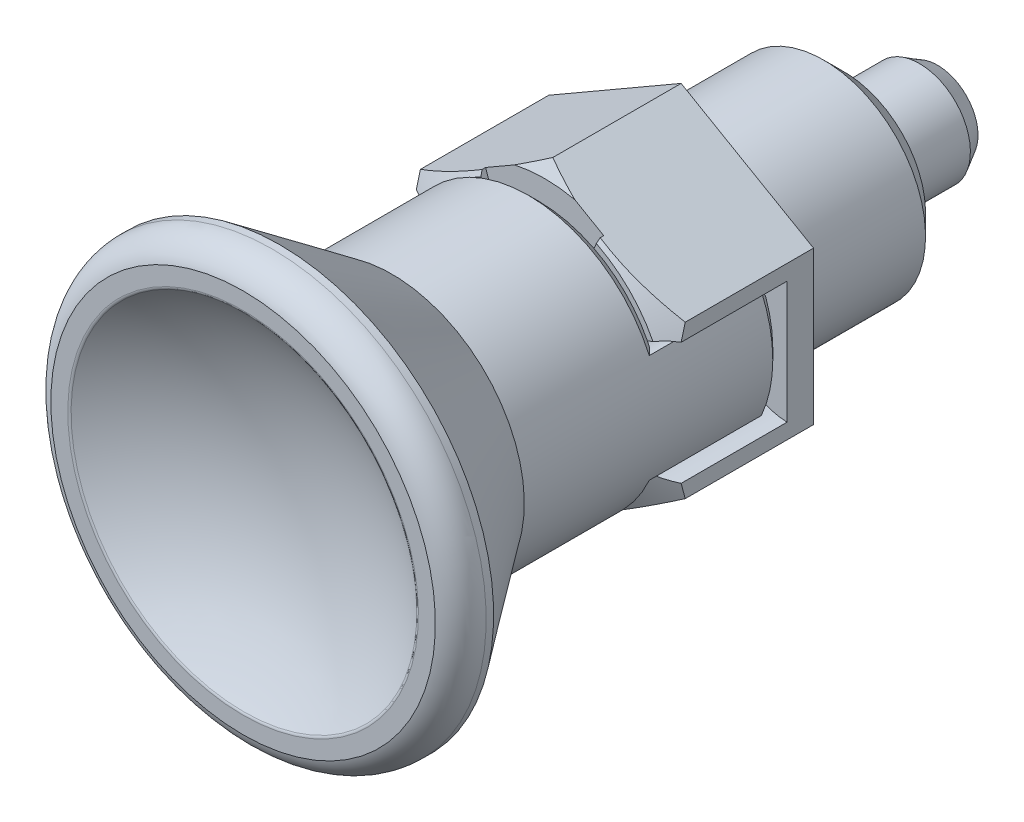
ISO-10303-21;
HEADER;
FILE_DESCRIPTION(('STEP AP214'),'2;1');
FILE_NAME('part.step','',(''),(''),'','','');
FILE_SCHEMA(('AUTOMOTIVE_DESIGN { 1 0 10303 214 1 1 1 1 }'));
ENDSEC;
DATA;
#1=APPLICATION_CONTEXT('core data for automotive mechanical design processes');
#2=APPLICATION_PROTOCOL_DEFINITION('international standard','automotive_design',2000,#1);
#3=PRODUCT_CONTEXT('',#1,'mechanical');
#4=PRODUCT('Part','Part','',(#3));
#5=PRODUCT_RELATED_PRODUCT_CATEGORY('part','',(#4));
#6=PRODUCT_DEFINITION_FORMATION('','',#4);
#7=PRODUCT_DEFINITION_CONTEXT('part definition',#1,'design');
#8=PRODUCT_DEFINITION('design','',#6,#7);
#9=PRODUCT_DEFINITION_SHAPE('','',#8);
#10=(LENGTH_UNIT() NAMED_UNIT(*) SI_UNIT(.MILLI.,.METRE.));
#11=(NAMED_UNIT(*) PLANE_ANGLE_UNIT() SI_UNIT($,.RADIAN.));
#12=(NAMED_UNIT(*) SI_UNIT($,.STERADIAN.) SOLID_ANGLE_UNIT());
#13=UNCERTAINTY_MEASURE_WITH_UNIT(LENGTH_MEASURE(1.E-05),#10,'distance_accuracy_value','');
#14=(GEOMETRIC_REPRESENTATION_CONTEXT(3) GLOBAL_UNCERTAINTY_ASSIGNED_CONTEXT((#13)) GLOBAL_UNIT_ASSIGNED_CONTEXT((#10,
#11,#12)) REPRESENTATION_CONTEXT('',''));
#15=CARTESIAN_POINT('',(0.,0.,0.));
#16=DIRECTION('',(0.,0.,1.));
#17=DIRECTION('',(1.,0.,0.));
#18=AXIS2_PLACEMENT_3D('',#15,#16,#17);
#19=CARTESIAN_POINT('',(0.,-1.28703991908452E-09,32.599147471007));
#20=DIRECTION('',(0.,0.,-1.));
#21=DIRECTION('',(1.74532925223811E-06,-0.999999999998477,0.));
#22=AXIS2_PLACEMENT_3D('',#19,#20,#21);
#23=SPHERICAL_SURFACE('',#22,14.0000000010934);
#24=CARTESIAN_POINT('',(0.,4.8919202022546E-13,21.4645927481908));
#25=DIRECTION('',(0.,0.,1.));
#26=DIRECTION('',(1.74532925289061E-06,-0.999999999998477,0.));
#27=AXIS2_PLACEMENT_3D('',#24,#25,#26);
#28=CIRCLE('',#27,8.48655944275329);
#29=CARTESIAN_POINT('',(1.48118404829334E-05,-8.48655944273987,21.464592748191));
#30=VERTEX_POINT('',#29);
#31=EDGE_CURVE('E427',#30,#30,#28,.T.);
#32=ORIENTED_EDGE('',*,*,#31,.T.);
#33=EDGE_LOOP('',(#32));
#34=FACE_BOUND('',#33,.T.);
#35=ADVANCED_FACE('F15',(#34),#23,.F.);
#36=CARTESIAN_POINT('',(1.48118404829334E-05,-8.48655944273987,21.464592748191));
#37=CARTESIAN_POINT('',(1.49049371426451E-05,-8.53989989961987,21.5066671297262));
#38=CARTESIAN_POINT('',(1.50234382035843E-05,-8.60779600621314,21.5055276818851));
#39=CARTESIAN_POINT('',(-14.6991373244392,-8.48658509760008,21.464592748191));
#40=CARTESIAN_POINT('',(-14.7915256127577,-8.53992571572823,21.5066671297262));
#41=CARTESIAN_POINT('',(-14.9091250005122,-8.60782202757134,21.505527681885));
#42=CARTESIAN_POINT('',(-7.34958347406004,4.24326689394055,21.4645927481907));
#43=CARTESIAN_POINT('',(-7.39577771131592,4.26993704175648,21.506667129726));
#44=CARTESIAN_POINT('',(-7.45457752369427,4.30388499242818,21.5055276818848));
#45=CARTESIAN_POINT('',(-2.96236808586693E-05,16.9731188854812,21.4645927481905));
#46=CARTESIAN_POINT('',(-2.98098741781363E-05,17.0797997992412,21.5066671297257));
#47=CARTESIAN_POINT('',(-3.00468763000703E-05,17.2155920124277,21.5055276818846));
#48=CARTESIAN_POINT('',(7.34956866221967,4.24329254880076,21.4645927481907));
#49=CARTESIAN_POINT('',(7.39576280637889,4.26996285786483,21.506667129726));
#50=CARTESIAN_POINT('',(7.45456250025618,4.30391101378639,21.5055276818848));
#51=CARTESIAN_POINT('',(14.6991669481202,-8.48653378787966,21.464592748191));
#52=CARTESIAN_POINT('',(14.791555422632,-8.53987408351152,21.5066671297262));
#53=CARTESIAN_POINT('',(14.9091550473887,-8.60776998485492,21.505527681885));
#54=CARTESIAN_POINT('',(1.48118404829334E-05,-8.48655944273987,21.464592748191));
#55=CARTESIAN_POINT('',(1.49049371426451E-05,-8.53989989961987,21.5066671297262));
#56=CARTESIAN_POINT('',(1.50234382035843E-05,-8.60779600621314,21.5055276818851));
#57=(BOUNDED_SURFACE() B_SPLINE_SURFACE(2,2,((#36,#37,#38),(#39,#40,#41),(#42,#43,#44),(#45,#46,
#47),(#48,#49,#50),(#51,#52,#53),(#54,#55,#56)),.UNSPECIFIED.,.T.,.F.,
.F.) B_SPLINE_SURFACE_WITH_KNOTS((3,2,2,3),(3,3),(0.,217.869655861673,435.739311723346,
653.60896758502),(0.,1.),
.UNSPECIFIED.) GEOMETRIC_REPRESENTATION_ITEM() RATIONAL_B_SPLINE_SURFACE(((1.,0.946908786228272,
1.),(0.5,0.473454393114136,0.5),(1.,0.946908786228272,1.),(0.5,0.473454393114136,0.5),(1.,
0.946908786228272,1.),(0.5,0.473454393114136,0.5),(1.,0.946908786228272,1.))) REPRESENTATION_ITEM('') SURFACE());
#58=CARTESIAN_POINT('',(0.,4.77048955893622E-13,21.5055276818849));
#59=DIRECTION('',(0.,0.,-1.));
#60=DIRECTION('',(1.74532925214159E-06,-0.999999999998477,0.));
#61=AXIS2_PLACEMENT_3D('',#58,#59,#60);
#62=CIRCLE('',#61,8.60779600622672);
#63=CARTESIAN_POINT('',(1.50234382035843E-05,-8.60779600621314,21.5055276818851));
#64=VERTEX_POINT('',#63);
#65=EDGE_CURVE('E423',#64,#64,#62,.T.);
#66=CARTESIAN_POINT('',(1.48118404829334E-05,-8.48655944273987,21.464592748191));
#67=CARTESIAN_POINT('',(1.48136794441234E-05,-8.48761308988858,21.465423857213));
#68=CARTESIAN_POINT('',(1.48155335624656E-05,-8.48867542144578,21.4662439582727));
#69=CARTESIAN_POINT('',(1.48192760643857E-05,-8.49081971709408,21.4678637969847));
#70=CARTESIAN_POINT('',(1.4821164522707E-05,-8.49190172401,21.4686634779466));
#71=CARTESIAN_POINT('',(1.48249748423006E-05,-8.49408487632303,21.4702417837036));
#72=CARTESIAN_POINT('',(1.48268967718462E-05,-8.49518606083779,21.4710203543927));
#73=CARTESIAN_POINT('',(1.483077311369E-05,-8.49740704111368,21.4725557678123));
#74=CARTESIAN_POINT('',(1.4832727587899E-05,-8.49852687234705,21.4733125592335));
#75=CARTESIAN_POINT('',(1.48366680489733E-05,-8.50078459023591,21.4748037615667));
#76=CARTESIAN_POINT('',(1.48386540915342E-05,-8.5019225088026,21.4755381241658));
#77=CARTESIAN_POINT('',(1.4842656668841E-05,-8.50421581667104,21.4769838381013));
#78=CARTESIAN_POINT('',(1.4844673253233E-05,-8.50537123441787,21.4776951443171));
#79=CARTESIAN_POINT('',(1.48487358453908E-05,-8.50769892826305,21.4790941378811));
#80=CARTESIAN_POINT('',(1.48507818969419E-05,-8.50887122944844,21.4797817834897));
#81=CARTESIAN_POINT('',(1.48549023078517E-05,-8.51123205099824,21.4811328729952));
#82=CARTESIAN_POINT('',(1.48569767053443E-05,-8.51242059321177,21.4817962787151));
#83=CARTESIAN_POINT('',(1.48611526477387E-05,-8.51481323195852,21.4830983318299));
#84=CARTESIAN_POINT('',(1.48632542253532E-05,-8.51601734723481,21.4837369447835));
#85=CARTESIAN_POINT('',(1.48674833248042E-05,-8.51844044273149,21.4849888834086));
#86=CARTESIAN_POINT('',(1.4869610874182E-05,-8.51965943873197,21.4856021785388));
#87=CARTESIAN_POINT('',(1.4873890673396E-05,-8.52211158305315,21.4868029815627));
#88=CARTESIAN_POINT('',(1.48760429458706E-05,-8.52334474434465,21.4873904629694));
#89=CARTESIAN_POINT('',(1.48803709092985E-05,-8.52582448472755,21.4885391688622));
#90=CARTESIAN_POINT('',(1.48825466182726E-05,-8.52707107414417,21.4891003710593));
#91=CARTESIAN_POINT('',(1.48869201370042E-05,-8.52957691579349,21.4901960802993));
#92=CARTESIAN_POINT('',(1.4889117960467E-05,-8.53083617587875,21.4907305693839));
#93=CARTESIAN_POINT('',(1.48935343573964E-05,-8.53336658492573,21.4917724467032));
#94=CARTESIAN_POINT('',(1.48957529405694E-05,-8.53463773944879,21.4922798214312));
#95=CARTESIAN_POINT('',(1.49002094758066E-05,-8.53719114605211,21.4932670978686));
#96=CARTESIAN_POINT('',(1.49024474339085E-05,-8.53847340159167,21.4937469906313));
#97=CARTESIAN_POINT('',(1.49069413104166E-05,-8.54104820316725,21.4946789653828));
#98=CARTESIAN_POINT('',(1.49091972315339E-05,-8.54234075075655,21.4951310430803));
#99=CARTESIAN_POINT('',(1.49137256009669E-05,-8.5449353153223,21.4960070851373));
#100=CARTESIAN_POINT('',(1.49159980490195E-05,-8.54623733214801,21.4964310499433));
#101=CARTESIAN_POINT('',(1.49205580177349E-05,-8.54885000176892,21.4972505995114));
#102=CARTESIAN_POINT('',(1.4922845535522E-05,-8.55016065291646,21.4976461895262));
#103=CARTESIAN_POINT('',(1.49274341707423E-05,-8.55278974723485,21.4984087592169));
#104=CARTESIAN_POINT('',(1.49297352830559E-05,-8.55410818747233,21.4987757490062));
#105=CARTESIAN_POINT('',(1.49343496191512E-05,-8.55675200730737,21.4994809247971));
#106=CARTESIAN_POINT('',(1.49366628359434E-05,-8.55807738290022,21.4998191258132));
#107=CARTESIAN_POINT('',(1.49412998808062E-05,-8.5607342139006,21.5004665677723));
#108=CARTESIAN_POINT('',(1.49436237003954E-05,-8.56206566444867,21.5007758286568));
#109=CARTESIAN_POINT('',(1.49482804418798E-05,-8.56473378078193,21.5013652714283));
#110=CARTESIAN_POINT('',(1.4950613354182E-05,-8.56607044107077,21.5016454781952));
#111=CARTESIAN_POINT('',(1.49552867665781E-05,-8.56874810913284,21.5021767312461));
#112=CARTESIAN_POINT('',(1.4957627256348E-05,-8.57008911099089,21.5024278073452));
#113=CARTESIAN_POINT('',(1.4962314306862E-05,-8.57277459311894,21.5029007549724));
#114=CARTESIAN_POINT('',(1.49646608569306E-05,-8.5741190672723,21.5031226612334));
#115=CARTESIAN_POINT('',(1.49693585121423E-05,-8.57681062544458,21.5035372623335));
#116=CARTESIAN_POINT('',(1.49717096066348E-05,-8.57815770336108,21.5037299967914));
#117=CARTESIAN_POINT('',(1.49764148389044E-05,-8.58085360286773,21.5040862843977));
#118=CARTESIAN_POINT('',(1.49787689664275E-05,-8.58220241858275,21.5042498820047));
#119=CARTESIAN_POINT('',(1.49834787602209E-05,-8.58490093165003,21.5045479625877));
#120=CARTESIAN_POINT('',(1.49858344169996E-05,-8.58625062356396,21.504682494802));
#121=CARTESIAN_POINT('',(1.49905457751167E-05,-8.58895003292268,21.5049225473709));
#122=CARTESIAN_POINT('',(1.49929014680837E-05,-8.59029974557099,21.5050281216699));
#123=CARTESIAN_POINT('',(1.49976114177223E-05,-8.59299834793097,21.5052103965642));
#124=CARTESIAN_POINT('',(1.49999656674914E-05,-8.59434723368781,21.5052871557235));
#125=CARTESIAN_POINT('',(1.50046712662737E-05,-8.59704334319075,21.5054119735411));
#126=CARTESIAN_POINT('',(1.50070226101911E-05,-8.59839056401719,21.5054600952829));
#127=CARTESIAN_POINT('',(1.50117209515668E-05,-8.60108251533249,21.5055278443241));
#128=CARTESIAN_POINT('',(1.50140679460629E-05,-8.60242724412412,21.5055475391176));
#129=CARTESIAN_POINT('',(1.50187561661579E-05,-8.60511339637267,21.5055586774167));
#130=CARTESIAN_POINT('',(1.50210973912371E-05,-8.60645481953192,21.5055501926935));
#131=CARTESIAN_POINT('',(1.50234382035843E-05,-8.60779600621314,21.5055276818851));
#132=B_SPLINE_CURVE_WITH_KNOTS('',3,(#66,#67,#68,#69,#70,#71,#72,#73,#74,#75,#76,#77,#78,#79,
#80,#81,#82,#83,#84,#85,#86,#87,#88,#89,#90,#91,#92,#93,#94,#95,#96,#97,#98,#99,#100,#101,#102,
#103,#104,#105,#106,#107,#108,#109,#110,#111,#112,#113,#114,#115,#116,#117,#118,#119,#120,#121,
#122,#123,#124,#125,#126,#127,#128,#129,#130,#131),.UNSPECIFIED.,.F.,.F.,(4,2,2,2,2,2,2,2,2,2,2,
2,2,2,2,2,2,2,2,2,2,2,2,2,2,2,2,2,2,2,2,2,4),(0.,0.00402587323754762,0.00806191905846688,
0.0121074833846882,0.0161619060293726,0.0202245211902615,0.0242946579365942,0.0283716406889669,
0.0324547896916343,0.0365434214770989,0.0406368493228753,0.0447343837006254,0.0488353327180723,
0.0529390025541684,0.0570446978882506,0.0611517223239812,0.0652593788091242,0.0693669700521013,
0.0734737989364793,0.0775791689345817,0.0816823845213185,0.0857827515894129,0.0898795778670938,
0.0939721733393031,0.0980598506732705,0.10214192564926,0.106217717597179,0.110286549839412,
0.114347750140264,0.118400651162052,0.122444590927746,0.126478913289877,0.130502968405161),.UNSPECIFIED.);
#133=EDGE_CURVE('BSEAM1666',#30,#64,#132,.T.);
#134=ORIENTED_EDGE('',*,*,#31,.F.);
#135=ORIENTED_EDGE('',*,*,#65,.F.);
#136=ORIENTED_EDGE('',*,*,#133,.T.);
#137=ORIENTED_EDGE('',*,*,#133,.F.);
#138=EDGE_LOOP('',(#134,#136,#135,#137));
#139=FACE_BOUND('',#138,.T.);
#140=ADVANCED_FACE('F1666',(#139),#57,.T.);
#141=CARTESIAN_POINT('',(-10.3840181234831,10.3839818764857,21.5055276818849));
#142=DIRECTION('',(0.,0.,1.));
#143=DIRECTION('',(1.74532925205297E-06,-0.999999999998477,0.));
#144=AXIS2_PLACEMENT_3D('',#141,#142,#143);
#145=PLANE('',#144);
#146=CARTESIAN_POINT('',(0.,4.77048955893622E-13,21.5055276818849));
#147=DIRECTION('',(0.,0.,-1.));
#148=DIRECTION('',(1.74532925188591E-06,-0.999999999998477,0.));
#149=AXIS2_PLACEMENT_3D('',#146,#147,#148);
#150=CIRCLE('',#149,9.44);
#151=CARTESIAN_POINT('',(1.64759081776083E-05,-9.43999999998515,21.5055276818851));
#152=VERTEX_POINT('',#151);
#153=EDGE_CURVE('E419',#152,#152,#150,.T.);
#154=ORIENTED_EDGE('',*,*,#153,.F.);
#155=EDGE_LOOP('',(#154));
#156=FACE_BOUND('',#155,.T.);
#157=ORIENTED_EDGE('',*,*,#65,.T.);
#158=EDGE_LOOP('',(#157));
#159=FACE_BOUND('',#158,.T.);
#160=ADVANCED_FACE('F1680',(#156,#159),#145,.T.);
#161=CARTESIAN_POINT('',(0.,4.54497550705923E-13,20.0715123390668));
#162=DIRECTION('',(0.,0.,-1.));
#163=DIRECTION('',(0.,1.,0.));
#164=AXIS2_PLACEMENT_3D('',#161,#162,#163);
#165=TOROIDAL_SURFACE('',#164,8.99999999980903,1.50000000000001);
#166=ORIENTED_EDGE('',*,*,#153,.T.);
#167=EDGE_LOOP('',(#166));
#168=FACE_BOUND('',#167,.T.);
#169=CARTESIAN_POINT('',(0.,4.54497550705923E-13,20.0715123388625));
#170=DIRECTION('',(0.,0.,-1.));
#171=DIRECTION('',(1.74532925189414E-06,-0.999999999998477,0.));
#172=AXIS2_PLACEMENT_3D('',#169,#170,#171);
#173=CIRCLE('',#172,10.499999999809);
#174=CARTESIAN_POINT('',(1.83259571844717E-05,-10.4999999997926,20.0715123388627));
#175=VERTEX_POINT('',#174);
#176=EDGE_CURVE('E412',#175,#175,#173,.T.);
#177=ORIENTED_EDGE('',*,*,#176,.F.);
#178=EDGE_LOOP('',(#177));
#179=FACE_BOUND('',#178,.T.);
#180=ADVANCED_FACE('F1692',(#168,#179),#165,.T.);
#181=CARTESIAN_POINT('',(0.,4.55921975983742E-13,20.0715123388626));
#182=DIRECTION('',(0.,0.,-1.));
#183=DIRECTION('',(1.74532925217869E-06,-0.999999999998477,0.));
#184=AXIS2_PLACEMENT_3D('',#181,#182,#183);
#185=CYLINDRICAL_SURFACE('',#184,10.5);
#186=ORIENTED_EDGE('',*,*,#176,.T.);
#187=EDGE_LOOP('',(#186));
#188=FACE_BOUND('',#187,.T.);
#189=CARTESIAN_POINT('',(0.,4.49293380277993E-13,19.7055276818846));
#190=DIRECTION('',(0.,0.,-1.));
#191=DIRECTION('',(1.74532925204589E-06,-0.999999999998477,0.));
#192=AXIS2_PLACEMENT_3D('',#189,#190,#191);
#193=CIRCLE('',#192,10.5);
#194=CARTESIAN_POINT('',(1.83259571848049E-05,-10.4999999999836,19.7055276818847));
#195=VERTEX_POINT('',#194);
#196=EDGE_CURVE('E411',#195,#195,#193,.T.);
#197=ORIENTED_EDGE('',*,*,#196,.F.);
#198=EDGE_LOOP('',(#197));
#199=FACE_BOUND('',#198,.T.);
#200=ADVANCED_FACE('F650',(#188,#199),#185,.T.);
#201=CARTESIAN_POINT('',(-4.1862550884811,2.91548139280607,1.50000000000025));
#202=DIRECTION('',(0.,0.,-1.));
#203=DIRECTION('',(1.7453292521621E-06,-0.999999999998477,0.));
#204=AXIS2_PLACEMENT_3D('',#201,#202,#203);
#205=PLANE('',#204);
#206=CARTESIAN_POINT('',(0.,1.40946282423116E-13,1.50000000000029));
#207=DIRECTION('',(0.,0.,-1.));
#208=DIRECTION('',(-0.940083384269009,-0.340944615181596,0.));
#209=AXIS2_PLACEMENT_3D('',#206,#207,#208);
#210=CIRCLE('',#209,5.99999999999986);
#211=CARTESIAN_POINT('',(-5.64050030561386,-2.04566769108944,1.50000000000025));
#212=VERTEX_POINT('',#211);
#213=CARTESIAN_POINT('',(-5.6405074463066,2.0456480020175,1.50000000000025));
#214=VERTEX_POINT('',#213);
#215=EDGE_CURVE('E593',#212,#214,#210,.T.);
#216=ORIENTED_EDGE('',*,*,#215,.T.);
#217=CARTESIAN_POINT('',(-6.44999999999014,-1.12573733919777E-05,1.50000000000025));
#218=DIRECTION('',(0.,0.,-1.));
#219=DIRECTION('',(0.367951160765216,0.929845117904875,0.));
#220=AXIS2_PLACEMENT_3D('',#217,#218,#219);
#221=CIRCLE('',#220,2.2000000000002);
#222=EDGE_CURVE('E589',#214,#212,#221,.T.);
#223=ORIENTED_EDGE('',*,*,#222,.T.);
#224=EDGE_LOOP('',(#216,#223));
#225=FACE_BOUND('',#224,.T.);
#226=ADVANCED_FACE('F644',(#225),#205,.T.);
#227=CARTESIAN_POINT('',(6.63749491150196,2.91550028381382,1.5));
#228=DIRECTION('',(0.,0.,-1.));
#229=DIRECTION('',(1.74532925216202E-06,-0.999999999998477,0.));
#230=AXIS2_PLACEMENT_3D('',#227,#228,#229);
#231=PLANE('',#230);
#232=CARTESIAN_POINT('',(6.44999999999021,1.12573739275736E-05,1.5));
#233=DIRECTION('',(0.,0.,-1.));
#234=DIRECTION('',(-0.36795116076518,-0.929845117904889,0.));
#235=AXIS2_PLACEMENT_3D('',#232,#233,#234);
#236=CIRCLE('',#235,2.19999999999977);
#237=CARTESIAN_POINT('',(5.6405074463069,-2.04564800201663,1.5));
#238=VERTEX_POINT('',#237);
#239=CARTESIAN_POINT('',(5.64050030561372,2.04566769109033,1.5));
#240=VERTEX_POINT('',#239);
#241=EDGE_CURVE('E612',#238,#240,#236,.T.);
#242=ORIENTED_EDGE('',*,*,#241,.T.);
#243=CARTESIAN_POINT('',(0.,1.39211558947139E-13,1.5));
#244=DIRECTION('',(0.,0.,-1.));
#245=DIRECTION('',(0.940083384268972,0.340944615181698,0.));
#246=AXIS2_PLACEMENT_3D('',#243,#244,#245);
#247=CIRCLE('',#246,5.99999999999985);
#248=EDGE_CURVE('E609',#240,#238,#247,.T.);
#249=ORIENTED_EDGE('',*,*,#248,.T.);
#250=EDGE_LOOP('',(#242,#249));
#251=FACE_BOUND('',#250,.T.);
#252=ADVANCED_FACE('F483',(#251),#231,.T.);
#253=CARTESIAN_POINT('',(6.44999999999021,1.12573739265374E-05,1.5));
#254=DIRECTION('',(0.,0.,1.));
#255=DIRECTION('',(-0.190710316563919,-0.981646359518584,0.));
#256=AXIS2_PLACEMENT_3D('',#253,#254,#255);
#257=CONICAL_SURFACE('',#256,2.19999999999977,0.785398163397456);
#258=CARTESIAN_POINT('',(5.64050744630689,-2.04564800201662,1.50000000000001));
#259=CARTESIAN_POINT('',(5.65296068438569,-2.0733401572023,1.52116405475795));
#260=CARTESIAN_POINT('',(5.66571084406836,-2.10085407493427,1.54238239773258));
#261=CARTESIAN_POINT('',(5.69112690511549,-2.15456487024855,1.58422017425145));
#262=CARTESIAN_POINT('',(5.70377896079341,-2.18077321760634,1.60483327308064));
#263=CARTESIAN_POINT('',(5.72875584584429,-2.23189688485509,1.64546884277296));
#264=CARTESIAN_POINT('',(5.74107393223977,-2.25682247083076,1.6654825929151));
#265=CARTESIAN_POINT('',(5.76525989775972,-2.30540017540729,1.70488273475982));
#266=CARTESIAN_POINT('',(5.77712468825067,-2.32906143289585,1.72425968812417));
#267=CARTESIAN_POINT('',(5.7984829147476,-2.3724283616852,1.76022862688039));
#268=CARTESIAN_POINT('',(5.80804747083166,-2.39214969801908,1.77675932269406));
#269=CARTESIAN_POINT('',(5.82868764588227,-2.43504390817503,1.81301494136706));
#270=CARTESIAN_POINT('',(5.83972603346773,-2.45820035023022,1.83278018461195));
#271=CARTESIAN_POINT('',(5.86365611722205,-2.50792132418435,1.87549508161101));
#272=CARTESIAN_POINT('',(5.87657020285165,-2.53445855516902,1.89846406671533));
#273=CARTESIAN_POINT('',(5.90453232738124,-2.59089014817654,1.94761602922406));
#274=CARTESIAN_POINT('',(5.91963135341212,-2.62074920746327,1.97381045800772));
#275=CARTESIAN_POINT('',(5.93508214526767,-2.65043391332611,2.00000000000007));
#276=B_SPLINE_CURVE_WITH_KNOTS('',3,(#258,#259,#260,#261,#262,#263,#264,#265,#266,#267,#268,
#269,#270,#271,#272,#273,#274,#275),.UNSPECIFIED.,.F.,.F.,(4,2,2,2,2,2,2,2,4),(0.,
0.111029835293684,0.218015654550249,0.320787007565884,0.41919524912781,0.501551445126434,
0.598703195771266,0.710893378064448,0.838371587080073),.UNSPECIFIED.);
#277=CARTESIAN_POINT('',(5.93508214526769,-2.65043391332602,2.));
#278=VERTEX_POINT('',#277);
#279=EDGE_CURVE('E431',#238,#278,#276,.T.);
#280=ORIENTED_EDGE('',*,*,#279,.T.);
#281=CARTESIAN_POINT('',(6.44999999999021,1.12573739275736E-05,2.));
#282=DIRECTION('',(0.,0.,1.));
#283=DIRECTION('',(-0.190713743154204,0.981645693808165,0.));
#284=AXIS2_PLACEMENT_3D('',#281,#282,#283);
#285=CIRCLE('',#284,2.69999999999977);
#286=CARTESIAN_POINT('',(5.93507289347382,2.6504546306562,2.));
#287=VERTEX_POINT('',#286);
#288=EDGE_CURVE('E516',#287,#278,#285,.T.);
#289=ORIENTED_EDGE('',*,*,#288,.F.);
#290=CARTESIAN_POINT('',(5.93507289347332,2.65045463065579,2.00000000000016));
#291=CARTESIAN_POINT('',(5.91962413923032,2.62077364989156,1.97381379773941));
#292=CARTESIAN_POINT('',(5.90452698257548,2.59091837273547,1.94762273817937));
#293=CARTESIAN_POINT('',(5.87656716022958,2.53449185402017,1.89847526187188));
#294=CARTESIAN_POINT('',(5.86365355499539,2.50795588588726,1.87550740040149));
#295=CARTESIAN_POINT('',(5.83972321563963,2.45823490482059,1.83279254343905));
#296=CARTESIAN_POINT('',(5.82868410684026,2.43507717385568,1.81302623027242));
#297=CARTESIAN_POINT('',(5.80804199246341,2.39217775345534,1.77676607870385));
#298=CARTESIAN_POINT('',(5.79847608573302,2.37245250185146,1.76023198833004));
#299=CARTESIAN_POINT('',(5.77711924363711,2.32908591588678,1.72426311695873));
#300=CARTESIAN_POINT('',(5.76525735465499,2.3054289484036,1.70488948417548));
#301=CARTESIAN_POINT('',(5.74107488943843,2.25685702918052,1.66549380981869));
#302=CARTESIAN_POINT('',(5.72875737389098,2.23193291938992,1.64548124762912));
#303=CARTESIAN_POINT('',(5.70378007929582,2.18080928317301,1.6048457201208));
#304=CARTESIAN_POINT('',(5.69112705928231,2.15459946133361,1.58423150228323));
#305=CARTESIAN_POINT('',(5.66570781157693,2.10088276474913,1.54238920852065));
#306=CARTESIAN_POINT('',(5.65295547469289,2.07336438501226,1.52116748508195));
#307=CARTESIAN_POINT('',(5.6405003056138,2.04566769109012,1.50000000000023));
#308=B_SPLINE_CURVE_WITH_KNOTS('',3,(#290,#291,#292,#293,#294,#295,#296,#297,#298,#299,#300,
#301,#302,#303,#304,#305,#306,#307),.UNSPECIFIED.,.F.,.F.,(4,2,2,2,2,2,2,2,4),(0.,
0.127462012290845,0.239646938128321,0.336804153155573,0.419176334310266,0.517566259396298,
0.620331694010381,0.727323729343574,0.838371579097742),.UNSPECIFIED.);
#309=EDGE_CURVE('E504',#287,#240,#308,.T.);
#310=ORIENTED_EDGE('',*,*,#309,.T.);
#311=ORIENTED_EDGE('',*,*,#241,.F.);
#312=EDGE_LOOP('',(#280,#289,#310,#311));
#313=FACE_BOUND('',#312,.T.);
#314=ADVANCED_FACE('F472',(#313),#257,.T.);
#315=CARTESIAN_POINT('',(-6.44999999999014,-1.12573733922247E-05,1.50000000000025));
#316=DIRECTION('',(0.,0.,1.));
#317=DIRECTION('',(0.190710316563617,0.981646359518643,0.));
#318=AXIS2_PLACEMENT_3D('',#315,#316,#317);
#319=CONICAL_SURFACE('',#318,2.20000000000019,0.785398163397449);
#320=CARTESIAN_POINT('',(-5.93508214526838,2.65043391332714,2.00000000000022));
#321=CARTESIAN_POINT('',(-5.92629674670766,2.63336023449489,1.98501517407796));
#322=CARTESIAN_POINT('',(-5.91767324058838,2.61611095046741,1.97014168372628));
#323=CARTESIAN_POINT('',(-5.8981191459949,2.57635211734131,1.93623705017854));
#324=CARTESIAN_POINT('',(-5.88724705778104,2.5537718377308,1.91725489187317));
#325=CARTESIAN_POINT('',(-5.86304096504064,2.50349739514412,1.87513448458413));
#326=CARTESIAN_POINT('',(-5.8497004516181,2.47578955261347,1.85201671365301));
#327=CARTESIAN_POINT('',(-5.82038164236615,2.41542997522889,1.80163220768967));
#328=CARTESIAN_POINT('',(-5.80436324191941,2.38279179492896,1.77437242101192));
#329=CARTESIAN_POINT('',(-5.77370930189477,2.32086473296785,1.72267295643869));
#330=CARTESIAN_POINT('',(-5.75909726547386,2.291570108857,1.69822618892));
#331=CARTESIAN_POINT('',(-5.73135458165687,2.23563555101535,1.65191833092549));
#332=CARTESIAN_POINT('',(-5.71821826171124,2.20901494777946,1.63003730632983));
#333=CARTESIAN_POINT('',(-5.6934792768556,2.15837071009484,1.58883719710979));
#334=CARTESIAN_POINT('',(-5.68186272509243,2.13437353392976,1.56949419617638));
#335=CARTESIAN_POINT('',(-5.66029373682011,2.08884415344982,1.53340110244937));
#336=CARTESIAN_POINT('',(-5.65030710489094,2.06735646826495,1.51661514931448));
#337=CARTESIAN_POINT('',(-5.64050744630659,2.04564800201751,1.50000000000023));
#338=B_SPLINE_CURVE_WITH_KNOTS('',3,(#320,#321,#322,#323,#324,#325,#326,#327,#328,#329,#330,
#331,#332,#333,#334,#335,#336,#337),.UNSPECIFIED.,.F.,.F.,(4,2,2,2,2,2,2,2,4),(0.,
0.0730625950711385,0.167376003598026,0.282793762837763,0.419117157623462,0.541688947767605,
0.652322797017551,0.751134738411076,0.838248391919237),.UNSPECIFIED.);
#339=CARTESIAN_POINT('',(-5.93508214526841,2.65043391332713,2.00000000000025));
#340=VERTEX_POINT('',#339);
#341=EDGE_CURVE('E558',#340,#214,#338,.T.);
#342=ORIENTED_EDGE('',*,*,#341,.F.);
#343=CARTESIAN_POINT('',(-6.44999999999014,-1.12573733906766E-05,2.00000000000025));
#344=DIRECTION('',(0.,0.,1.));
#345=DIRECTION('',(0.190713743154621,-0.981645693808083,0.));
#346=AXIS2_PLACEMENT_3D('',#343,#344,#345);
#347=CIRCLE('',#346,2.70000000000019);
#348=CARTESIAN_POINT('',(-5.93507289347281,-2.65045463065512,2.00000000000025));
#349=VERTEX_POINT('',#348);
#350=EDGE_CURVE('E568',#349,#340,#347,.T.);
#351=ORIENTED_EDGE('',*,*,#350,.F.);
#352=CARTESIAN_POINT('',(-5.64050030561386,-2.04566769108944,1.50000000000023));
#353=CARTESIAN_POINT('',(-5.65029917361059,-2.06737455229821,1.51661391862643));
#354=CARTESIAN_POINT('',(-5.66028502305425,-2.08886063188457,1.53339863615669));
#355=CARTESIAN_POINT('',(-5.68185293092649,-2.13438788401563,1.56949007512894));
#356=CARTESIAN_POINT('',(-5.69346919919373,-2.15838452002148,1.58883267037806));
#357=CARTESIAN_POINT('',(-5.71820806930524,-2.20902879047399,1.63003278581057));
#358=CARTESIAN_POINT('',(-5.73134455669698,-2.23564996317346,1.65191422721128));
#359=CARTESIAN_POINT('',(-5.75908797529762,-2.29158682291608,1.69822373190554));
#360=CARTESIAN_POINT('',(-5.77370056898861,-2.32088318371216,1.72267173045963));
#361=CARTESIAN_POINT('',(-5.80435485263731,-2.38281238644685,1.77437247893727));
#362=CARTESIAN_POINT('',(-5.82037304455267,-2.41545097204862,1.8016323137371));
#363=CARTESIAN_POINT('',(-5.84969153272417,-2.4758110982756,1.8520168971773));
#364=CARTESIAN_POINT('',(-5.86303191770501,-2.50351910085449,1.87513468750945));
#365=CARTESIAN_POINT('',(-5.88723782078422,-2.55379363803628,1.91725509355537));
#366=CARTESIAN_POINT('',(-5.89810983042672,-2.57637386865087,1.93623722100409));
#367=CARTESIAN_POINT('',(-5.91766389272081,-2.61613232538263,1.97014177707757));
#368=CARTESIAN_POINT('',(-5.92628740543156,-2.6333813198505,1.98501520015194));
#369=CARTESIAN_POINT('',(-5.93507289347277,-2.65045463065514,2.00000000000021));
#370=B_SPLINE_CURVE_WITH_KNOTS('',3,(#352,#353,#354,#355,#356,#357,#358,#359,#360,#361,#362,
#363,#364,#365,#366,#367,#368,#369),.UNSPECIFIED.,.F.,.F.,(4,2,2,2,2,2,2,2,4),(0.,
0.0871071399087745,0.185916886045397,0.296552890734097,0.419131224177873,0.555455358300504,
0.670873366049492,0.765186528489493,0.838248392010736),.UNSPECIFIED.);
#371=EDGE_CURVE('E523',#212,#349,#370,.T.);
#372=ORIENTED_EDGE('',*,*,#371,.F.);
#373=ORIENTED_EDGE('',*,*,#222,.F.);
#374=EDGE_LOOP('',(#342,#351,#372,#373));
#375=FACE_BOUND('',#374,.T.);
#376=ADVANCED_FACE('F482',(#375),#319,.T.);
#377=CARTESIAN_POINT('',(0.,3.47311272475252E-13,14.2));
#378=DIRECTION('',(0.,0.,1.));
#379=DIRECTION('',(1.74532925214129E-06,-0.999999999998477,0.));
#380=AXIS2_PLACEMENT_3D('',#377,#378,#379);
#381=CONICAL_SURFACE('',#380,6.50000000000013,0.628318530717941);
#382=ORIENTED_EDGE('',*,*,#196,.T.);
#383=EDGE_LOOP('',(#382));
#384=FACE_BOUND('',#383,.T.);
#385=CARTESIAN_POINT('',(0.,3.60822483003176E-13,14.2));
#386=DIRECTION('',(0.,0.,1.));
#387=DIRECTION('',(1.74532925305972E-06,-0.999999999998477,0.));
#388=AXIS2_PLACEMENT_3D('',#385,#386,#387);
#389=CIRCLE('',#388,6.50000000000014);
#390=CARTESIAN_POINT('',(1.13446401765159E-05,-6.49999999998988,14.2000000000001));
#391=VERTEX_POINT('',#390);
#392=EDGE_CURVE('E404',#391,#391,#389,.T.);
#393=ORIENTED_EDGE('',*,*,#392,.T.);
#394=EDGE_LOOP('',(#393));
#395=FACE_BOUND('',#394,.T.);
#396=ADVANCED_FACE('F537',(#384,#395),#381,.T.);
#397=CARTESIAN_POINT('',(0.,1.39833253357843E-13,1.50000000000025));
#398=DIRECTION('',(0.,0.,1.));
#399=DIRECTION('',(-0.913088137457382,-0.407762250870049,0.));
#400=AXIS2_PLACEMENT_3D('',#397,#398,#399);
#401=CONICAL_SURFACE('',#400,5.99999999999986,0.785398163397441);
#402=ORIENTED_EDGE('',*,*,#371,.T.);
#403=CARTESIAN_POINT('',(0.,1.42247325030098E-13,2.00000000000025));
#404=DIRECTION('',(0.,0.,1.));
#405=DIRECTION('',(-0.913089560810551,0.407759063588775,0.));
#406=AXIS2_PLACEMENT_3D('',#403,#404,#405);
#407=CIRCLE('',#406,6.49999999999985);
#408=EDGE_CURVE('E395',#340,#349,#407,.T.);
#409=ORIENTED_EDGE('',*,*,#408,.F.);
#410=ORIENTED_EDGE('',*,*,#341,.T.);
#411=ORIENTED_EDGE('',*,*,#215,.F.);
#412=EDGE_LOOP('',(#402,#409,#410,#411));
#413=FACE_BOUND('',#412,.T.);
#414=ADVANCED_FACE('F528',(#413),#401,.T.);
#415=CARTESIAN_POINT('',(0.,1.38385226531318E-13,1.5));
#416=DIRECTION('',(0.,0.,1.));
#417=DIRECTION('',(0.913088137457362,0.407762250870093,0.));
#418=AXIS2_PLACEMENT_3D('',#415,#416,#417);
#419=CONICAL_SURFACE('',#418,5.99999999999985,0.785398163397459);
#420=ORIENTED_EDGE('',*,*,#309,.F.);
#421=CARTESIAN_POINT('',(0.,1.32272665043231E-13,2.));
#422=DIRECTION('',(0.,0.,1.));
#423=DIRECTION('',(0.913089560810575,-0.407759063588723,0.));
#424=AXIS2_PLACEMENT_3D('',#421,#422,#423);
#425=CIRCLE('',#424,6.49999999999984);
#426=EDGE_CURVE('E394',#278,#287,#425,.T.);
#427=ORIENTED_EDGE('',*,*,#426,.F.);
#428=ORIENTED_EDGE('',*,*,#279,.F.);
#429=ORIENTED_EDGE('',*,*,#248,.F.);
#430=EDGE_LOOP('',(#420,#427,#428,#429));
#431=FACE_BOUND('',#430,.T.);
#432=ADVANCED_FACE('F484',(#431),#419,.T.);
#433=CARTESIAN_POINT('',(6.44999999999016,1.12573735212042E-05,7.82499999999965));
#434=DIRECTION('',(0.,1.99256500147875E-13,-1.));
#435=DIRECTION('',(-0.0552038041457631,-0.998475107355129,-1.99786810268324E-13));
#436=AXIS2_PLACEMENT_3D('',#433,#434,#435);
#437=CYLINDRICAL_SURFACE('',#436,2.7);
#438=CARTESIAN_POINT('',(5.93508214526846,-2.65043391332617,7.5));
#439=CARTESIAN_POINT('',(5.76853104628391,-2.61807703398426,7.33473011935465));
#440=CARTESIAN_POINT('',(5.60631605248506,-2.57026104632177,7.16740993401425));
#441=CARTESIAN_POINT('',(5.45058577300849,-2.50820946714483,7.));
#442=B_SPLINE_CURVE_WITH_KNOTS('',3,(#438,#439,#440,#441),.UNSPECIFIED.,.F.,.F.,(4,4),(0.,
0.000710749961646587),.UNSPECIFIED.);
#443=CARTESIAN_POINT('',(5.93508214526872,-2.65043391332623,7.5));
#444=VERTEX_POINT('',#443);
#445=CARTESIAN_POINT('',(5.4505857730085,-2.50820946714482,7.));
#446=VERTEX_POINT('',#445);
#447=EDGE_CURVE('E363',#444,#446,#442,.T.);
#448=ORIENTED_EDGE('',*,*,#447,.T.);
#449=CARTESIAN_POINT('',(6.44999999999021,1.12573741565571E-05,7.));
#450=DIRECTION('',(0.,0.,-1.));
#451=DIRECTION('',(-0.370153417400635,-0.928970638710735,0.));
#452=AXIS2_PLACEMENT_3D('',#449,#450,#451);
#453=CIRCLE('',#452,2.7);
#454=CARTESIAN_POINT('',(5.45057701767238,2.50822849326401,7.));
#455=VERTEX_POINT('',#454);
#456=EDGE_CURVE('E359',#446,#455,#453,.T.);
#457=ORIENTED_EDGE('',*,*,#456,.T.);
#458=CARTESIAN_POINT('',(5.45057701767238,2.50822849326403,7.));
#459=CARTESIAN_POINT('',(5.60630708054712,2.57028061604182,7.16740993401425));
#460=CARTESIAN_POINT('',(5.7685219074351,2.61809716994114,7.33473011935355));
#461=CARTESIAN_POINT('',(5.93507289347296,2.65045463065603,7.5));
#462=B_SPLINE_CURVE_WITH_KNOTS('',3,(#458,#459,#460,#461),.UNSPECIFIED.,.F.,.F.,(4,4),(0.,
0.00071074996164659),.UNSPECIFIED.);
#463=CARTESIAN_POINT('',(5.93507289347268,2.65045463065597,7.5));
#464=VERTEX_POINT('',#463);
#465=EDGE_CURVE('E364',#455,#464,#462,.T.);
#466=ORIENTED_EDGE('',*,*,#465,.T.);
#467=DIRECTION('',(0.,0.,-1.));
#468=VECTOR('',#467,1.);
#469=CARTESIAN_POINT('',(5.93507289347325,2.65045463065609,7.5));
#470=LINE('',#469,#468);
#471=EDGE_CURVE('E378',#464,#287,#470,.T.);
#472=ORIENTED_EDGE('',*,*,#471,.T.);
#473=ORIENTED_EDGE('',*,*,#288,.T.);
#474=DIRECTION('',(0.,0.,1.));
#475=VECTOR('',#474,1.);
#476=CARTESIAN_POINT('',(5.93508214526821,-2.65043391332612,2.));
#477=LINE('',#476,#475);
#478=EDGE_CURVE('E402',#278,#444,#477,.T.);
#479=ORIENTED_EDGE('',*,*,#478,.T.);
#480=EDGE_LOOP('',(#448,#457,#466,#472,#473,#479));
#481=FACE_BOUND('',#480,.T.);
#482=ADVANCED_FACE('F640',(#481),#437,.T.);
#483=CARTESIAN_POINT('',(-6.44999999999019,-1.12573735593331E-05,7.82500000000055));
#484=DIRECTION('',(0.,1.16685229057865E-13,-1.));
#485=DIRECTION('',(0.0618326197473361,0.998086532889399,1.17238139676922E-13));
#486=AXIS2_PLACEMENT_3D('',#483,#484,#485);
#487=CYLINDRICAL_SURFACE('',#486,2.7);
#488=CARTESIAN_POINT('',(-5.4505770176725,-2.50822849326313,7.));
#489=CARTESIAN_POINT('',(-5.60630708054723,-2.5702806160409,7.16740993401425));
#490=CARTESIAN_POINT('',(-5.76852190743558,-2.61809716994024,7.3347301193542));
#491=CARTESIAN_POINT('',(-5.93507289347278,-2.65045463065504,7.5));
#492=B_SPLINE_CURVE_WITH_KNOTS('',3,(#488,#489,#490,#491),.UNSPECIFIED.,.F.,.F.,(4,4),(0.,
0.00071074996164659),.UNSPECIFIED.);
#493=CARTESIAN_POINT('',(-5.45057701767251,-2.50822849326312,7.));
#494=VERTEX_POINT('',#493);
#495=CARTESIAN_POINT('',(-5.93507289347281,-2.65045463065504,7.5));
#496=VERTEX_POINT('',#495);
#497=EDGE_CURVE('E396',#494,#496,#492,.T.);
#498=ORIENTED_EDGE('',*,*,#497,.T.);
#499=DIRECTION('',(0.,0.,-1.));
#500=VECTOR('',#499,1.);
#501=CARTESIAN_POINT('',(-5.93507289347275,-2.65045463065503,7.5));
#502=LINE('',#501,#500);
#503=EDGE_CURVE('E403',#496,#349,#502,.T.);
#504=ORIENTED_EDGE('',*,*,#503,.T.);
#505=ORIENTED_EDGE('',*,*,#350,.T.);
#506=DIRECTION('',(0.,0.,1.));
#507=VECTOR('',#506,1.);
#508=CARTESIAN_POINT('',(-5.93508214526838,2.65043391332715,2.00000000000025));
#509=LINE('',#508,#507);
#510=CARTESIAN_POINT('',(-5.93508214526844,2.65043391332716,7.5));
#511=VERTEX_POINT('',#510);
#512=EDGE_CURVE('E387',#340,#511,#509,.T.);
#513=ORIENTED_EDGE('',*,*,#512,.T.);
#514=CARTESIAN_POINT('',(-5.93508214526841,2.65043391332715,7.5));
#515=CARTESIAN_POINT('',(-5.76853104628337,2.61807703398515,7.3347301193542));
#516=CARTESIAN_POINT('',(-5.60631605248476,2.57026104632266,7.16740993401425));
#517=CARTESIAN_POINT('',(-5.45058577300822,2.50820946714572,7.));
#518=B_SPLINE_CURVE_WITH_KNOTS('',3,(#514,#515,#516,#517),.UNSPECIFIED.,.F.,.F.,(4,4),(0.,
0.00071074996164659),.UNSPECIFIED.);
#519=CARTESIAN_POINT('',(-5.45058577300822,2.50820946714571,7.));
#520=VERTEX_POINT('',#519);
#521=EDGE_CURVE('E350',#511,#520,#518,.T.);
#522=ORIENTED_EDGE('',*,*,#521,.T.);
#523=CARTESIAN_POINT('',(-6.44999999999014,-1.12573731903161E-05,7.00000000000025));
#524=DIRECTION('',(0.,0.,-1.));
#525=DIRECTION('',(0.370153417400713,0.928970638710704,0.));
#526=AXIS2_PLACEMENT_3D('',#523,#524,#525);
#527=CIRCLE('',#526,2.7);
#528=EDGE_CURVE('E346',#520,#494,#527,.T.);
#529=ORIENTED_EDGE('',*,*,#528,.T.);
#530=EDGE_LOOP('',(#498,#504,#505,#513,#522,#529));
#531=FACE_BOUND('',#530,.T.);
#532=ADVANCED_FACE('F1765',(#531),#487,.T.);
#533=CARTESIAN_POINT('',(0.,3.50514701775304E-13,14.3));
#534=DIRECTION('',(0.,0.,-1.));
#535=DIRECTION('',(1.74532925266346E-06,-0.999999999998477,0.));
#536=AXIS2_PLACEMENT_3D('',#533,#534,#535);
#537=CYLINDRICAL_SURFACE('',#536,6.49999999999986);
#538=ORIENTED_EDGE('',*,*,#503,.F.);
#539=CARTESIAN_POINT('',(0.,2.30718222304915E-13,7.5));
#540=DIRECTION('',(0.,0.,1.));
#541=DIRECTION('',(1.74532925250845E-06,-0.999999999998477,0.));
#542=AXIS2_PLACEMENT_3D('',#539,#540,#541);
#543=CIRCLE('',#542,6.49999999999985);
#544=EDGE_CURVE('E351',#496,#444,#543,.T.);
#545=ORIENTED_EDGE('',*,*,#544,.T.);
#546=ORIENTED_EDGE('',*,*,#478,.F.);
#547=ORIENTED_EDGE('',*,*,#426,.T.);
#548=ORIENTED_EDGE('',*,*,#471,.F.);
#549=CARTESIAN_POINT('',(0.,2.2811613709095E-13,7.5));
#550=DIRECTION('',(0.,0.,1.));
#551=DIRECTION('',(0.913088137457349,0.407762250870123,0.));
#552=AXIS2_PLACEMENT_3D('',#549,#550,#551);
#553=CIRCLE('',#552,6.49999999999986);
#554=EDGE_CURVE('E388',#464,#511,#553,.T.);
#555=ORIENTED_EDGE('',*,*,#554,.T.);
#556=ORIENTED_EDGE('',*,*,#512,.F.);
#557=ORIENTED_EDGE('',*,*,#408,.T.);
#558=EDGE_LOOP('',(#538,#545,#546,#547,#548,#555,#556,#557));
#559=FACE_BOUND('',#558,.T.);
#560=ORIENTED_EDGE('',*,*,#392,.F.);
#561=EDGE_LOOP('',(#560));
#562=FACE_BOUND('',#561,.T.);
#563=ADVANCED_FACE('F958',(#559,#562),#537,.T.);
#564=CARTESIAN_POINT('',(0.,2.3189592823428E-13,7.));
#565=DIRECTION('',(0.,0.,1.));
#566=DIRECTION('',(-0.913089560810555,0.407759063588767,0.));
#567=AXIS2_PLACEMENT_3D('',#564,#565,#566);
#568=CONICAL_SURFACE('',#567,5.99999999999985,0.785398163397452);
#569=ORIENTED_EDGE('',*,*,#521,.F.);
#570=ORIENTED_EDGE('',*,*,#554,.F.);
#571=ORIENTED_EDGE('',*,*,#465,.F.);
#572=CARTESIAN_POINT('',(0.,2.34621350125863E-13,7.));
#573=DIRECTION('',(0.,0.,-1.));
#574=DIRECTION('',(-0.908430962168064,0.418034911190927,0.));
#575=AXIS2_PLACEMENT_3D('',#572,#573,#574);
#576=CIRCLE('',#575,5.99999999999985);
#577=CARTESIAN_POINT('',(5.34545454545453,2.72509003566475,7.));
#578=VERTEX_POINT('',#577);
#579=EDGE_CURVE('E358',#578,#455,#576,.T.);
#580=ORIENTED_EDGE('',*,*,#579,.F.);
#581=CARTESIAN_POINT('',(2.72509003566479,5.34545454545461,7.));
#582=VERTEX_POINT('',#581);
#583=EDGE_CURVE('E908',#582,#578,#576,.T.);
#584=ORIENTED_EDGE('',*,*,#583,.F.);
#585=CARTESIAN_POINT('',(-2.72509003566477,5.34545454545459,7.));
#586=VERTEX_POINT('',#585);
#587=EDGE_CURVE('E915',#586,#582,#576,.T.);
#588=ORIENTED_EDGE('',*,*,#587,.F.);
#589=CARTESIAN_POINT('',(-5.34545454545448,2.72509003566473,7.));
#590=VERTEX_POINT('',#589);
#591=EDGE_CURVE('E357',#590,#586,#576,.T.);
#592=ORIENTED_EDGE('',*,*,#591,.F.);
#593=EDGE_CURVE('E352',#520,#590,#576,.T.);
#594=ORIENTED_EDGE('',*,*,#593,.F.);
#595=EDGE_LOOP('',(#569,#570,#571,#580,#584,#588,#592,#594));
#596=FACE_BOUND('',#595,.T.);
#597=ADVANCED_FACE('F906',(#596),#568,.T.);
#598=CARTESIAN_POINT('',(7.14998752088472,7.15001247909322,7.));
#599=DIRECTION('',(0.,0.,-1.));
#600=DIRECTION('',(1.74532925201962E-06,-0.999999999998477,0.));
#601=AXIS2_PLACEMENT_3D('',#598,#599,#600);
#602=PLANE('',#601);
#603=ORIENTED_EDGE('',*,*,#587,.T.);
#604=CARTESIAN_POINT('',(0.,6.6,7.));
#605=DIRECTION('',(0.,0.,-1.));
#606=DIRECTION('',(0.944959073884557,-0.327188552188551,0.));
#607=AXIS2_PLACEMENT_3D('',#604,#605,#606);
#608=CIRCLE('',#607,3.);
#609=EDGE_CURVE('E933',#582,#586,#608,.T.);
#610=ORIENTED_EDGE('',*,*,#609,.T.);
#611=EDGE_LOOP('',(#603,#610));
#612=FACE_BOUND('',#611,.T.);
#613=ADVANCED_FACE('F1796',(#612),#602,.T.);
#614=CARTESIAN_POINT('',(0.,2.30492873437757E-13,7.));
#615=DIRECTION('',(0.,0.,1.));
#616=DIRECTION('',(0.913089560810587,-0.407759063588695,0.));
#617=AXIS2_PLACEMENT_3D('',#614,#615,#616);
#618=CONICAL_SURFACE('',#617,5.99999999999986,0.785398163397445);
#619=ORIENTED_EDGE('',*,*,#447,.F.);
#620=ORIENTED_EDGE('',*,*,#544,.F.);
#621=ORIENTED_EDGE('',*,*,#497,.F.);
#622=CARTESIAN_POINT('',(0.,2.32452945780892E-13,7.));
#623=DIRECTION('',(0.,0.,-1.));
#624=DIRECTION('',(1.7453292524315E-06,-0.999999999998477,0.));
#625=AXIS2_PLACEMENT_3D('',#622,#623,#624);
#626=CIRCLE('',#625,5.99999999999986);
#627=CARTESIAN_POINT('',(-5.34545454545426,-2.72509003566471,7.));
#628=VERTEX_POINT('',#627);
#629=EDGE_CURVE('E356',#628,#494,#626,.T.);
#630=ORIENTED_EDGE('',*,*,#629,.F.);
#631=CARTESIAN_POINT('',(-2.7250900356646,-5.34545454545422,7.));
#632=VERTEX_POINT('',#631);
#633=EDGE_CURVE('E439',#632,#628,#626,.T.);
#634=ORIENTED_EDGE('',*,*,#633,.F.);
#635=CARTESIAN_POINT('',(2.72509003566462,-5.34545454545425,7.));
#636=VERTEX_POINT('',#635);
#637=EDGE_CURVE('E31',#636,#632,#626,.T.);
#638=ORIENTED_EDGE('',*,*,#637,.F.);
#639=CARTESIAN_POINT('',(0.,2.33320307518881E-13,7.));
#640=DIRECTION('',(0.,0.,-1.));
#641=DIRECTION('',(0.908430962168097,-0.418034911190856,0.));
#642=AXIS2_PLACEMENT_3D('',#639,#640,#641);
#643=CIRCLE('',#642,5.99999999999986);
#644=CARTESIAN_POINT('',(5.34545454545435,-2.72509003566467,7.));
#645=VERTEX_POINT('',#644);
#646=EDGE_CURVE('E438',#645,#636,#643,.T.);
#647=ORIENTED_EDGE('',*,*,#646,.F.);
#648=EDGE_CURVE('E442',#446,#645,#643,.T.);
#649=ORIENTED_EDGE('',*,*,#648,.F.);
#650=EDGE_LOOP('',(#619,#620,#621,#630,#634,#638,#647,#649));
#651=FACE_BOUND('',#650,.T.);
#652=ADVANCED_FACE('F954',(#651),#618,.T.);
#653=ORIENTED_EDGE('',*,*,#648,.T.);
#654=CARTESIAN_POINT('',(6.6,0.,7.));
#655=DIRECTION('',(0.,0.,-1.));
#656=DIRECTION('',(-1.,0.,0.));
#657=AXIS2_PLACEMENT_3D('',#654,#655,#656);
#658=CIRCLE('',#657,3.);
#659=EDGE_CURVE('E39',#645,#578,#658,.T.);
#660=ORIENTED_EDGE('',*,*,#659,.T.);
#661=ORIENTED_EDGE('',*,*,#579,.T.);
#662=ORIENTED_EDGE('',*,*,#456,.F.);
#663=EDGE_LOOP('',(#653,#660,#661,#662));
#664=FACE_BOUND('',#663,.T.);
#665=ADVANCED_FACE('F952',(#664),#602,.T.);
#666=ORIENTED_EDGE('',*,*,#637,.T.);
#667=CARTESIAN_POINT('',(0.,-6.6,7.));
#668=DIRECTION('',(0.,0.,-1.));
#669=DIRECTION('',(-0.944959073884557,0.327188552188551,0.));
#670=AXIS2_PLACEMENT_3D('',#667,#668,#669);
#671=CIRCLE('',#670,3.);
#672=EDGE_CURVE('E798',#632,#636,#671,.T.);
#673=ORIENTED_EDGE('',*,*,#672,.T.);
#674=EDGE_LOOP('',(#666,#673));
#675=FACE_BOUND('',#674,.T.);
#676=ADVANCED_FACE('F1823',(#675),#602,.T.);
#677=ORIENTED_EDGE('',*,*,#593,.T.);
#678=CARTESIAN_POINT('',(-6.6,0.,7.));
#679=DIRECTION('',(0.,0.,-1.));
#680=DIRECTION('',(0.327188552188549,0.944959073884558,0.));
#681=AXIS2_PLACEMENT_3D('',#678,#679,#680);
#682=CIRCLE('',#681,3.00000000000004);
#683=EDGE_CURVE('E2080',#590,#628,#682,.T.);
#684=ORIENTED_EDGE('',*,*,#683,.T.);
#685=ORIENTED_EDGE('',*,*,#629,.T.);
#686=ORIENTED_EDGE('',*,*,#528,.F.);
#687=EDGE_LOOP('',(#677,#684,#685,#686));
#688=FACE_BOUND('',#687,.T.);
#689=ADVANCED_FACE('F688',(#688),#602,.T.);
#690=CARTESIAN_POINT('',(0.,0.,-8.));
#691=DIRECTION('',(0.,0.,-1.));
#692=DIRECTION('',(0.,-1.,0.));
#693=AXIS2_PLACEMENT_3D('',#690,#691,#692);
#694=SPHERICAL_SURFACE('',#693,5.);
#695=CARTESIAN_POINT('',(0.,0.,-12.588122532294));
#696=DIRECTION('',(0.,0.,1.));
#697=DIRECTION('',(0.,-1.,0.));
#698=AXIS2_PLACEMENT_3D('',#695,#696,#697);
#699=CIRCLE('',#698,1.9872422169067);
#700=CARTESIAN_POINT('',(0.,-1.9872422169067,-12.588122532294));
#701=VERTEX_POINT('',#700);
#702=EDGE_CURVE('E1649',#701,#701,#699,.T.);
#703=ORIENTED_EDGE('',*,*,#702,.F.);
#704=EDGE_LOOP('',(#703));
#705=FACE_BOUND('',#704,.T.);
#706=ADVANCED_FACE('F1037',(#705),#694,.T.);
#707=CARTESIAN_POINT('',(0.,0.,-12.588122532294));
#708=DIRECTION('',(0.,0.,1.));
#709=DIRECTION('',(0.,-1.,0.));
#710=AXIS2_PLACEMENT_3D('',#707,#708,#709);
#711=CONICAL_SURFACE('',#710,1.9872422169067,0.523598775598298);
#712=CARTESIAN_POINT('',(0.,0.,-11.7));
#713=DIRECTION('',(0.,0.,1.));
#714=DIRECTION('',(0.,-1.,0.));
#715=AXIS2_PLACEMENT_3D('',#712,#713,#714);
#716=CIRCLE('',#715,2.5);
#717=CARTESIAN_POINT('',(0.,-2.5,-11.7));
#718=VERTEX_POINT('',#717);
#719=EDGE_CURVE('E1641',#718,#718,#716,.T.);
#720=ORIENTED_EDGE('',*,*,#719,.F.);
#721=EDGE_LOOP('',(#720));
#722=FACE_BOUND('',#721,.T.);
#723=ORIENTED_EDGE('',*,*,#702,.T.);
#724=EDGE_LOOP('',(#723));
#725=FACE_BOUND('',#724,.T.);
#726=ADVANCED_FACE('F1042',(#722,#725),#711,.T.);
#727=CARTESIAN_POINT('',(0.,0.,-8.5));
#728=DIRECTION('',(0.,0.,-1.));
#729=DIRECTION('',(0.,-1.,0.));
#730=AXIS2_PLACEMENT_3D('',#727,#728,#729);
#731=CYLINDRICAL_SURFACE('',#730,2.5);
#732=CARTESIAN_POINT('',(0.,0.,-8.5));
#733=DIRECTION('',(0.,0.,1.));
#734=DIRECTION('',(0.,-1.,0.));
#735=AXIS2_PLACEMENT_3D('',#732,#733,#734);
#736=CIRCLE('',#735,2.5);
#737=CARTESIAN_POINT('',(0.,-2.5,-8.5));
#738=VERTEX_POINT('',#737);
#739=EDGE_CURVE('E1633',#738,#738,#736,.T.);
#740=ORIENTED_EDGE('',*,*,#739,.F.);
#741=EDGE_LOOP('',(#740));
#742=FACE_BOUND('',#741,.T.);
#743=ORIENTED_EDGE('',*,*,#719,.T.);
#744=EDGE_LOOP('',(#743));
#745=FACE_BOUND('',#744,.T.);
#746=ADVANCED_FACE('F1053',(#742,#745),#731,.T.);
#747=CARTESIAN_POINT('',(0.,0.,-8.37320508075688));
#748=DIRECTION('',(0.,0.,-1.));
#749=DIRECTION('',(0.,-1.,0.));
#750=AXIS2_PLACEMENT_3D('',#747,#748,#749);
#751=CONICAL_SURFACE('',#750,2.42679491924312,0.523598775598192);
#752=CARTESIAN_POINT('',(0.,0.,-8.37320508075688));
#753=DIRECTION('',(0.,0.,1.));
#754=DIRECTION('',(0.,-1.,0.));
#755=AXIS2_PLACEMENT_3D('',#752,#753,#754);
#756=CIRCLE('',#755,2.42679491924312);
#757=CARTESIAN_POINT('',(0.,-2.42679491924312,-8.37320508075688));
#758=VERTEX_POINT('',#757);
#759=EDGE_CURVE('E1625',#758,#758,#756,.T.);
#760=ORIENTED_EDGE('',*,*,#759,.F.);
#761=EDGE_LOOP('',(#760));
#762=FACE_BOUND('',#761,.T.);
#763=ORIENTED_EDGE('',*,*,#739,.T.);
#764=EDGE_LOOP('',(#763));
#765=FACE_BOUND('',#764,.T.);
#766=ADVANCED_FACE('F1063',(#762,#765),#751,.T.);
#767=CARTESIAN_POINT('',(0.,0.,-8.27320508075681));
#768=DIRECTION('',(0.,0.,-1.));
#769=DIRECTION('',(-1.,0.,0.));
#770=AXIS2_PLACEMENT_3D('',#767,#768,#769);
#771=TOROIDAL_SURFACE('',#770,2.60000000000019,0.200000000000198);
#772=CARTESIAN_POINT('',(0.,0.,-8.27320508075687));
#773=DIRECTION('',(0.,0.,1.));
#774=DIRECTION('',(0.,-1.,0.));
#775=AXIS2_PLACEMENT_3D('',#772,#773,#774);
#776=CIRCLE('',#775,2.4);
#777=CARTESIAN_POINT('',(0.,-2.4,-8.27320508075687));
#778=VERTEX_POINT('',#777);
#779=EDGE_CURVE('E1617',#778,#778,#776,.T.);
#780=ORIENTED_EDGE('',*,*,#779,.F.);
#781=EDGE_LOOP('',(#780));
#782=FACE_BOUND('',#781,.T.);
#783=ORIENTED_EDGE('',*,*,#759,.T.);
#784=EDGE_LOOP('',(#783));
#785=FACE_BOUND('',#784,.T.);
#786=ADVANCED_FACE('F1073',(#782,#785),#771,.F.);
#787=CARTESIAN_POINT('',(0.,0.,-8.2));
#788=DIRECTION('',(0.,0.,-1.));
#789=DIRECTION('',(0.,-1.,0.));
#790=AXIS2_PLACEMENT_3D('',#787,#788,#789);
#791=CYLINDRICAL_SURFACE('',#790,2.4);
#792=CARTESIAN_POINT('',(0.,0.,-8.2));
#793=DIRECTION('',(0.,0.,1.));
#794=DIRECTION('',(0.,-1.,0.));
#795=AXIS2_PLACEMENT_3D('',#792,#793,#794);
#796=CIRCLE('',#795,2.4);
#797=CARTESIAN_POINT('',(0.,-2.4,-8.2));
#798=VERTEX_POINT('',#797);
#799=EDGE_CURVE('E774',#798,#798,#796,.T.);
#800=ORIENTED_EDGE('',*,*,#799,.F.);
#801=EDGE_LOOP('',(#800));
#802=FACE_BOUND('',#801,.T.);
#803=ORIENTED_EDGE('',*,*,#779,.T.);
#804=EDGE_LOOP('',(#803));
#805=FACE_BOUND('',#804,.T.);
#806=ADVANCED_FACE('F1083',(#802,#805),#791,.T.);
#807=CARTESIAN_POINT('',(0.,0.,-8.2));
#808=DIRECTION('',(0.,0.,-1.));
#809=DIRECTION('',(-1.,0.,0.));
#810=AXIS2_PLACEMENT_3D('',#807,#808,#809);
#811=TOROIDAL_SURFACE('',#810,2.6,0.200000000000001);
#812=CARTESIAN_POINT('',(0.,0.,-8.));
#813=DIRECTION('',(0.,0.,-1.));
#814=DIRECTION('',(0.,-1.,0.));
#815=AXIS2_PLACEMENT_3D('',#812,#813,#814);
#816=CIRCLE('',#815,2.6);
#817=CARTESIAN_POINT('',(0.,-2.6,-8.));
#818=VERTEX_POINT('',#817);
#819=EDGE_CURVE('E299',#818,#818,#816,.T.);
#820=ORIENTED_EDGE('',*,*,#819,.T.);
#821=EDGE_LOOP('',(#820));
#822=FACE_BOUND('',#821,.T.);
#823=ORIENTED_EDGE('',*,*,#799,.T.);
#824=EDGE_LOOP('',(#823));
#825=FACE_BOUND('',#824,.T.);
#826=ADVANCED_FACE('F17',(#822,#825),#811,.F.);
#827=CARTESIAN_POINT('',(0.,0.,-8.));
#828=DIRECTION('',(0.,0.,-1.));
#829=DIRECTION('',(1.,0.,0.));
#830=AXIS2_PLACEMENT_3D('',#827,#828,#829);
#831=PLANE('',#830);
#832=CARTESIAN_POINT('',(0.,0.,-8.));
#833=DIRECTION('',(0.,0.,-1.));
#834=DIRECTION('',(0.,-1.,0.));
#835=AXIS2_PLACEMENT_3D('',#832,#833,#834);
#836=CIRCLE('',#835,4.);
#837=CARTESIAN_POINT('',(0.,-4.,-8.));
#838=VERTEX_POINT('',#837);
#839=EDGE_CURVE('E24',#838,#838,#836,.T.);
#840=ORIENTED_EDGE('',*,*,#839,.T.);
#841=EDGE_LOOP('',(#840));
#842=FACE_BOUND('',#841,.T.);
#843=ORIENTED_EDGE('',*,*,#819,.F.);
#844=EDGE_LOOP('',(#843));
#845=FACE_BOUND('',#844,.T.);
#846=ADVANCED_FACE('F730',(#842,#845),#831,.T.);
#847=CARTESIAN_POINT('',(0.,0.,0.));
#848=DIRECTION('',(0.,0.,-1.));
#849=DIRECTION('',(0.,-1.,0.));
#850=AXIS2_PLACEMENT_3D('',#847,#848,#849);
#851=CYLINDRICAL_SURFACE('',#850,5.);
#852=CARTESIAN_POINT('',(0.,0.,-7.));
#853=DIRECTION('',(0.,0.,-1.));
#854=DIRECTION('',(0.,-1.,0.));
#855=AXIS2_PLACEMENT_3D('',#852,#853,#854);
#856=CIRCLE('',#855,5.);
#857=CARTESIAN_POINT('',(0.,-5.,-7.));
#858=VERTEX_POINT('',#857);
#859=EDGE_CURVE('E9',#858,#858,#856,.F.);
#860=ORIENTED_EDGE('',*,*,#859,.T.);
#861=EDGE_LOOP('',(#860));
#862=FACE_BOUND('',#861,.T.);
#863=CARTESIAN_POINT('',(0.,0.,0.));
#864=DIRECTION('',(0.,0.,1.));
#865=DIRECTION('',(0.,-1.,0.));
#866=AXIS2_PLACEMENT_3D('',#863,#864,#865);
#867=CIRCLE('',#866,5.);
#868=CARTESIAN_POINT('',(0.,-5.,0.));
#869=VERTEX_POINT('',#868);
#870=EDGE_CURVE('E1422',#869,#869,#867,.T.);
#871=ORIENTED_EDGE('',*,*,#870,.F.);
#872=EDGE_LOOP('',(#871));
#873=FACE_BOUND('',#872,.T.);
#874=ADVANCED_FACE('F720',(#862,#873),#851,.T.);
#875=CARTESIAN_POINT('',(0.,0.,7.));
#876=DIRECTION('',(0.,0.,-1.));
#877=DIRECTION('',(0.,-1.,0.));
#878=AXIS2_PLACEMENT_3D('',#875,#876,#877);
#879=CONICAL_SURFACE('',#878,6.29311793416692,1.0471975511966);
#880=CARTESIAN_POINT('',(-1.48294029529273,-6.64937752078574,6.69999999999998));
#881=CARTESIAN_POINT('',(-0.777347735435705,-7.05675157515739,6.55911591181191));
#882=CARTESIAN_POINT('',(0.,-7.50555349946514,6.3));
#883=(BOUNDED_CURVE() B_SPLINE_CURVE(2,(#880,#881,#882),.UNSPECIFIED.,.F.,
.F.) B_SPLINE_CURVE_WITH_KNOTS((3,3),(0.786003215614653,1.),
.UNSPECIFIED.) CURVE() GEOMETRIC_REPRESENTATION_ITEM() RATIONAL_B_SPLINE_CURVE((1.05204192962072,
1.03310541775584,1.)) REPRESENTATION_ITEM(''));
#884=CARTESIAN_POINT('',(-1.48294029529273,-6.64937752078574,6.7));
#885=VERTEX_POINT('',#884);
#886=CARTESIAN_POINT('',(0.,-7.50555349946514,6.3));
#887=VERTEX_POINT('',#886);
#888=EDGE_CURVE('E825',#885,#887,#883,.T.);
#889=ORIENTED_EDGE('',*,*,#888,.T.);
#890=CARTESIAN_POINT('',(0.,-7.50555349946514,6.3));
#891=CARTESIAN_POINT('',(0.777347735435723,-7.05675157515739,6.55911591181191));
#892=CARTESIAN_POINT('',(1.48294029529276,-6.64937752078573,6.70000000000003));
#893=(BOUNDED_CURVE() B_SPLINE_CURVE(2,(#890,#891,#892),.UNSPECIFIED.,.F.,
.F.) B_SPLINE_CURVE_WITH_KNOTS((3,3),(0.,0.213996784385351),
.UNSPECIFIED.) CURVE() GEOMETRIC_REPRESENTATION_ITEM() RATIONAL_B_SPLINE_CURVE((1.,
1.03310541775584,1.05204192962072)) REPRESENTATION_ITEM(''));
#894=CARTESIAN_POINT('',(1.48294029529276,-6.64937752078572,6.7));
#895=VERTEX_POINT('',#894);
#896=EDGE_CURVE('E788',#887,#895,#893,.T.);
#897=ORIENTED_EDGE('',*,*,#896,.T.);
#898=CARTESIAN_POINT('',(0.,-2.25514051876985E-13,6.7));
#899=DIRECTION('',(0.,0.,-1.));
#900=DIRECTION('',(0.217671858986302,-0.976022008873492,0.));
#901=AXIS2_PLACEMENT_3D('',#898,#899,#900);
#902=CIRCLE('',#901,6.81273317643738);
#903=EDGE_CURVE('E784',#895,#885,#902,.T.);
#904=ORIENTED_EDGE('',*,*,#903,.T.);
#905=EDGE_LOOP('',(#889,#897,#904));
#906=FACE_BOUND('',#905,.T.);
#907=ADVANCED_FACE('F709',(#906),#879,.T.);
#908=CARTESIAN_POINT('',(1.48294029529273,6.64937752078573,6.69999999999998));
#909=CARTESIAN_POINT('',(0.777347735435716,7.05675157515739,6.55911591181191));
#910=CARTESIAN_POINT('',(0.,7.50555349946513,6.3));
#911=(BOUNDED_CURVE() B_SPLINE_CURVE(2,(#908,#909,#910),.UNSPECIFIED.,.F.,
.F.) B_SPLINE_CURVE_WITH_KNOTS((3,3),(0.786003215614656,1.),
.UNSPECIFIED.) CURVE() GEOMETRIC_REPRESENTATION_ITEM() RATIONAL_B_SPLINE_CURVE((1.05204192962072,
1.03310541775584,1.)) REPRESENTATION_ITEM(''));
#912=CARTESIAN_POINT('',(1.48294029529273,6.64937752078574,6.7));
#913=VERTEX_POINT('',#912);
#914=CARTESIAN_POINT('',(0.,7.50555349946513,6.3));
#915=VERTEX_POINT('',#914);
#916=EDGE_CURVE('E1331',#913,#915,#911,.T.);
#917=ORIENTED_EDGE('',*,*,#916,.T.);
#918=CARTESIAN_POINT('',(0.,7.50555349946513,6.3));
#919=CARTESIAN_POINT('',(-0.777347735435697,7.05675157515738,6.55911591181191));
#920=CARTESIAN_POINT('',(-1.48294029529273,6.64937752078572,6.70000000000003));
#921=(BOUNDED_CURVE() B_SPLINE_CURVE(2,(#918,#919,#920),.UNSPECIFIED.,.F.,
.F.) B_SPLINE_CURVE_WITH_KNOTS((3,3),(0.,0.213996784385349),
.UNSPECIFIED.) CURVE() GEOMETRIC_REPRESENTATION_ITEM() RATIONAL_B_SPLINE_CURVE((1.,
1.03310541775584,1.05204192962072)) REPRESENTATION_ITEM(''));
#922=CARTESIAN_POINT('',(-1.48294029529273,6.64937752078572,6.7));
#923=VERTEX_POINT('',#922);
#924=EDGE_CURVE('E1339',#915,#923,#921,.T.);
#925=ORIENTED_EDGE('',*,*,#924,.T.);
#926=CARTESIAN_POINT('',(0.,0.,6.7));
#927=DIRECTION('',(0.,0.,-1.));
#928=DIRECTION('',(-0.217671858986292,0.976022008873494,0.));
#929=AXIS2_PLACEMENT_3D('',#926,#927,#928);
#930=CIRCLE('',#929,6.81273317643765);
#931=EDGE_CURVE('E1347',#923,#913,#930,.T.);
#932=ORIENTED_EDGE('',*,*,#931,.T.);
#933=EDGE_LOOP('',(#917,#925,#932));
#934=FACE_BOUND('',#933,.T.);
#935=ADVANCED_FACE('F702',(#934),#879,.T.);
#936=CARTESIAN_POINT('',(7.5,-9.9,0.));
#937=DIRECTION('',(0.,0.,-1.));
#938=DIRECTION('',(-1.,0.,0.));
#939=AXIS2_PLACEMENT_3D('',#936,#937,#938);
#940=PLANE('',#939);
#941=DIRECTION('',(0.,1.,0.));
#942=VECTOR('',#941,1.);
#943=CARTESIAN_POINT('',(-6.5,-3.75277674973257,0.));
#944=LINE('',#943,#942);
#945=CARTESIAN_POINT('',(-6.5,-3.75277674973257,0.));
#946=VERTEX_POINT('',#945);
#947=CARTESIAN_POINT('',(-6.5,3.75277674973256,0.));
#948=VERTEX_POINT('',#947);
#949=EDGE_CURVE('E1376',#946,#948,#944,.T.);
#950=ORIENTED_EDGE('',*,*,#949,.T.);
#951=DIRECTION('',(0.866025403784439,0.5,0.));
#952=VECTOR('',#951,1.);
#953=CARTESIAN_POINT('',(-6.5,3.75277674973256,0.));
#954=LINE('',#953,#952);
#955=CARTESIAN_POINT('',(0.,7.50555349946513,0.));
#956=VERTEX_POINT('',#955);
#957=EDGE_CURVE('E1384',#948,#956,#954,.T.);
#958=ORIENTED_EDGE('',*,*,#957,.T.);
#959=DIRECTION('',(0.866025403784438,-0.5,0.));
#960=VECTOR('',#959,1.);
#961=CARTESIAN_POINT('',(0.,7.50555349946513,0.));
#962=LINE('',#961,#960);
#963=CARTESIAN_POINT('',(6.5,3.75277674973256,0.));
#964=VERTEX_POINT('',#963);
#965=EDGE_CURVE('E1392',#956,#964,#962,.T.);
#966=ORIENTED_EDGE('',*,*,#965,.T.);
#967=DIRECTION('',(0.,-1.,0.));
#968=VECTOR('',#967,1.);
#969=CARTESIAN_POINT('',(6.5,3.75277674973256,0.));
#970=LINE('',#969,#968);
#971=CARTESIAN_POINT('',(6.5,-3.75277674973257,0.));
#972=VERTEX_POINT('',#971);
#973=EDGE_CURVE('E1400',#964,#972,#970,.T.);
#974=ORIENTED_EDGE('',*,*,#973,.T.);
#975=DIRECTION('',(-0.866025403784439,-0.5,0.));
#976=VECTOR('',#975,1.);
#977=CARTESIAN_POINT('',(6.5,-3.75277674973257,0.));
#978=LINE('',#977,#976);
#979=CARTESIAN_POINT('',(0.,-7.50555349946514,0.));
#980=VERTEX_POINT('',#979);
#981=EDGE_CURVE('E1407',#972,#980,#978,.T.);
#982=ORIENTED_EDGE('',*,*,#981,.T.);
#983=DIRECTION('',(-0.866025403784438,0.5,0.));
#984=VECTOR('',#983,1.);
#985=CARTESIAN_POINT('',(0.,-7.50555349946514,0.));
#986=LINE('',#985,#984);
#987=EDGE_CURVE('E1415',#980,#946,#986,.T.);
#988=ORIENTED_EDGE('',*,*,#987,.T.);
#989=EDGE_LOOP('',(#950,#958,#966,#974,#982,#988));
#990=FACE_BOUND('',#989,.T.);
#991=ORIENTED_EDGE('',*,*,#870,.T.);
#992=EDGE_LOOP('',(#991));
#993=FACE_BOUND('',#992,.T.);
#994=ADVANCED_FACE('F728',(#990,#993),#940,.T.);
#995=CARTESIAN_POINT('',(-3.45000019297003,-3.15000023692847,1.3));
#996=DIRECTION('',(0.,0.,-1.));
#997=DIRECTION('',(-1.,0.,0.));
#998=AXIS2_PLACEMENT_3D('',#995,#996,#997);
#999=PLANE('',#998);
#1000=CARTESIAN_POINT('',(-6.6,0.,1.3));
#1001=DIRECTION('',(0.,0.,1.));
#1002=DIRECTION('',(0.0333333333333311,-0.999444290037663,0.));
#1003=AXIS2_PLACEMENT_3D('',#1000,#1001,#1002);
#1004=CIRCLE('',#1003,3.);
#1005=CARTESIAN_POINT('',(-6.5,-2.998332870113,1.3));
#1006=VERTEX_POINT('',#1005);
#1007=CARTESIAN_POINT('',(-6.5,2.99833287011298,1.3));
#1008=VERTEX_POINT('',#1007);
#1009=EDGE_CURVE('E773',#1006,#1008,#1004,.T.);
#1010=ORIENTED_EDGE('',*,*,#1009,.T.);
#1011=DIRECTION('',(0.,-1.,0.));
#1012=VECTOR('',#1011,1.);
#1013=CARTESIAN_POINT('',(-6.5,2.99833287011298,1.3));
#1014=LINE('',#1013,#1012);
#1015=EDGE_CURVE('E764',#1008,#1006,#1014,.T.);
#1016=ORIENTED_EDGE('',*,*,#1015,.T.);
#1017=EDGE_LOOP('',(#1010,#1016));
#1018=FACE_BOUND('',#1017,.T.);
#1019=ADVANCED_FACE('F748',(#1018),#999,.F.);
#1020=CARTESIAN_POINT('',(-6.5,3.75277674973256,7.));
#1021=DIRECTION('',(1.,0.,0.));
#1022=DIRECTION('',(0.,-1.,0.));
#1023=AXIS2_PLACEMENT_3D('',#1020,#1021,#1022);
#1024=PLANE('',#1023);
#1025=ORIENTED_EDGE('',*,*,#1015,.F.);
#1026=DIRECTION('',(0.,0.,-1.));
#1027=VECTOR('',#1026,1.);
#1028=CARTESIAN_POINT('',(-6.5,2.99833287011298,6.500537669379));
#1029=LINE('',#1028,#1027);
#1030=CARTESIAN_POINT('',(-6.5,2.99833287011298,6.500537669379));
#1031=VERTEX_POINT('',#1030);
#1032=EDGE_CURVE('E766',#1031,#1008,#1029,.T.);
#1033=ORIENTED_EDGE('',*,*,#1032,.F.);
#1034=CARTESIAN_POINT('',(-6.5,2.99833287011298,6.50053766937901));
#1035=CARTESIAN_POINT('',(-6.5,3.36661953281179,6.41147398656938));
#1036=CARTESIAN_POINT('',(-6.5,3.75277674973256,6.3));
#1037=(BOUNDED_CURVE() B_SPLINE_CURVE(2,(#1034,#1035,#1036),.UNSPECIFIED.,.F.,
.F.) B_SPLINE_CURVE_WITH_KNOTS((3,3),(0.,0.0903588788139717),
.UNSPECIFIED.) CURVE() GEOMETRIC_REPRESENTATION_ITEM() RATIONAL_B_SPLINE_CURVE((1.02543095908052,
1.01397856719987,1.)) REPRESENTATION_ITEM(''));
#1038=CARTESIAN_POINT('',(-6.5,3.75277674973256,6.3));
#1039=VERTEX_POINT('',#1038);
#1040=EDGE_CURVE('E1430',#1031,#1039,#1037,.T.);
#1041=ORIENTED_EDGE('',*,*,#1040,.T.);
#1042=DIRECTION('',(0.,0.,-1.));
#1043=VECTOR('',#1042,1.);
#1044=CARTESIAN_POINT('',(-6.5,3.75277674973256,6.3));
#1045=LINE('',#1044,#1043);
#1046=EDGE_CURVE('E1437',#1039,#948,#1045,.T.);
#1047=ORIENTED_EDGE('',*,*,#1046,.T.);
#1048=ORIENTED_EDGE('',*,*,#949,.F.);
#1049=DIRECTION('',(0.,0.,1.));
#1050=VECTOR('',#1049,1.);
#1051=CARTESIAN_POINT('',(-6.5,-3.75277674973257,0.));
#1052=LINE('',#1051,#1050);
#1053=CARTESIAN_POINT('',(-6.5,-3.75277674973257,6.3));
#1054=VERTEX_POINT('',#1053);
#1055=EDGE_CURVE('E792',#946,#1054,#1052,.T.);
#1056=ORIENTED_EDGE('',*,*,#1055,.T.);
#1057=CARTESIAN_POINT('',(-6.5,-3.75277674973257,6.3));
#1058=CARTESIAN_POINT('',(-6.5,-3.3666195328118,6.41147398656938));
#1059=CARTESIAN_POINT('',(-6.5,-2.998332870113,6.50053766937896));
#1060=(BOUNDED_CURVE() B_SPLINE_CURVE(2,(#1057,#1058,#1059),.UNSPECIFIED.,.F.,
.F.) B_SPLINE_CURVE_WITH_KNOTS((3,3),(0.90964112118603,1.),
.UNSPECIFIED.) CURVE() GEOMETRIC_REPRESENTATION_ITEM() RATIONAL_B_SPLINE_CURVE((1.,
1.01397856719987,1.02543095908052)) REPRESENTATION_ITEM(''));
#1061=CARTESIAN_POINT('',(-6.5,-2.998332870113,6.500537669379));
#1062=VERTEX_POINT('',#1061);
#1063=EDGE_CURVE('E781',#1054,#1062,#1060,.T.);
#1064=ORIENTED_EDGE('',*,*,#1063,.T.);
#1065=DIRECTION('',(0.,0.,1.));
#1066=VECTOR('',#1065,1.);
#1067=CARTESIAN_POINT('',(-6.5,-2.998332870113,1.3));
#1068=LINE('',#1067,#1066);
#1069=EDGE_CURVE('E769',#1006,#1062,#1068,.T.);
#1070=ORIENTED_EDGE('',*,*,#1069,.F.);
#1071=EDGE_LOOP('',(#1025,#1033,#1041,#1047,#1048,#1056,#1064,#1070));
#1072=FACE_BOUND('',#1071,.T.);
#1073=ADVANCED_FACE('F703',(#1072),#1024,.F.);
#1074=CARTESIAN_POINT('',(0.,-7.50555349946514,7.));
#1075=DIRECTION('',(-0.5,0.866025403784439,0.));
#1076=DIRECTION('',(0.866025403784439,0.5,0.));
#1077=AXIS2_PLACEMENT_3D('',#1074,#1075,#1076);
#1078=PLANE('',#1077);
#1079=DIRECTION('',(-0.866025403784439,-0.5,0.));
#1080=VECTOR('',#1079,1.);
#1081=CARTESIAN_POINT('',(2.89985114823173,-5.83132365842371,6.7));
#1082=LINE('',#1081,#1080);
#1083=CARTESIAN_POINT('',(2.89985114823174,-5.8313236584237,6.7));
#1084=VERTEX_POINT('',#1083);
#1085=EDGE_CURVE('E823',#1084,#895,#1082,.T.);
#1086=ORIENTED_EDGE('',*,*,#1085,.T.);
#1087=ORIENTED_EDGE('',*,*,#896,.F.);
#1088=DIRECTION('',(0.,0.,-1.));
#1089=VECTOR('',#1088,1.);
#1090=CARTESIAN_POINT('',(0.,-7.50555349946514,6.3));
#1091=LINE('',#1090,#1089);
#1092=EDGE_CURVE('E816',#887,#980,#1091,.T.);
#1093=ORIENTED_EDGE('',*,*,#1092,.T.);
#1094=ORIENTED_EDGE('',*,*,#981,.F.);
#1095=DIRECTION('',(0.,0.,-1.));
#1096=VECTOR('',#1095,1.);
#1097=CARTESIAN_POINT('',(6.5,-3.75277674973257,6.3));
#1098=LINE('',#1097,#1096);
#1099=CARTESIAN_POINT('',(6.5,-3.75277674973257,6.3));
#1100=VERTEX_POINT('',#1099);
#1101=EDGE_CURVE('E1260',#1100,#972,#1098,.T.);
#1102=ORIENTED_EDGE('',*,*,#1101,.F.);
#1103=CARTESIAN_POINT('',(2.89985114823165,-5.83132365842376,6.8733035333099));
#1104=CARTESIAN_POINT('',(4.572415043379,-4.86566844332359,6.94252831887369));
#1105=CARTESIAN_POINT('',(6.5,-3.75277674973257,6.3));
#1106=(BOUNDED_CURVE() B_SPLINE_CURVE(2,(#1103,#1104,#1105),.UNSPECIFIED.,.F.,
.F.) B_SPLINE_CURVE_WITH_KNOTS((3,3),(0.442020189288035,1.),
.UNSPECIFIED.) CURVE() GEOMETRIC_REPRESENTATION_ITEM() RATIONAL_B_SPLINE_CURVE((1.07631016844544,
1.08631977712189,1.)) REPRESENTATION_ITEM(''));
#1107=CARTESIAN_POINT('',(2.89985114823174,-5.83132365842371,6.8733035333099));
#1108=VERTEX_POINT('',#1107);
#1109=EDGE_CURVE('E852',#1108,#1100,#1106,.T.);
#1110=ORIENTED_EDGE('',*,*,#1109,.F.);
#1111=DIRECTION('',(0.,0.,-1.));
#1112=VECTOR('',#1111,1.);
#1113=CARTESIAN_POINT('',(2.89985114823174,-5.8313236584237,6.8733035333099));
#1114=LINE('',#1113,#1112);
#1115=EDGE_CURVE('E824',#1108,#1084,#1114,.T.);
#1116=ORIENTED_EDGE('',*,*,#1115,.T.);
#1117=EDGE_LOOP('',(#1086,#1087,#1093,#1094,#1102,#1110,#1116));
#1118=FACE_BOUND('',#1117,.T.);
#1119=ADVANCED_FACE('F744',(#1118),#1078,.F.);
#1120=CARTESIAN_POINT('',(3.14999977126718,-6.9127331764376,6.7));
#1121=DIRECTION('',(0.,0.,-1.));
#1122=DIRECTION('',(-1.,0.,0.));
#1123=AXIS2_PLACEMENT_3D('',#1120,#1121,#1122);
#1124=PLANE('',#1123);
#1125=ORIENTED_EDGE('',*,*,#903,.F.);
#1126=ORIENTED_EDGE('',*,*,#1085,.F.);
#1127=CARTESIAN_POINT('',(0.,-6.6,6.7));
#1128=DIRECTION('',(0.,0.,-1.));
#1129=DIRECTION('',(-0.966617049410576,0.256225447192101,0.));
#1130=AXIS2_PLACEMENT_3D('',#1127,#1128,#1129);
#1131=CIRCLE('',#1130,3.);
#1132=CARTESIAN_POINT('',(-2.89985114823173,-5.83132365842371,6.7));
#1133=VERTEX_POINT('',#1132);
#1134=EDGE_CURVE('E840',#1133,#1084,#1131,.T.);
#1135=ORIENTED_EDGE('',*,*,#1134,.F.);
#1136=DIRECTION('',(-0.866025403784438,0.5,0.));
#1137=VECTOR('',#1136,1.);
#1138=CARTESIAN_POINT('',(-1.48294029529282,-6.64937752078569,6.7));
#1139=LINE('',#1138,#1137);
#1140=EDGE_CURVE('E815',#885,#1133,#1139,.T.);
#1141=ORIENTED_EDGE('',*,*,#1140,.F.);
#1142=EDGE_LOOP('',(#1125,#1126,#1135,#1141));
#1143=FACE_BOUND('',#1142,.T.);
#1144=ADVANCED_FACE('F757',(#1143),#1124,.F.);
#1145=CARTESIAN_POINT('',(-6.5,-3.75277674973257,7.));
#1146=DIRECTION('',(0.5,0.866025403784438,0.));
#1147=DIRECTION('',(0.866025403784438,-0.5,0.));
#1148=AXIS2_PLACEMENT_3D('',#1145,#1146,#1147);
#1149=PLANE('',#1148);
#1150=CARTESIAN_POINT('',(-6.5,-3.75277674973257,6.3));
#1151=CARTESIAN_POINT('',(-4.572415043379,-4.86566844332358,6.94252831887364));
#1152=CARTESIAN_POINT('',(-2.89985114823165,-5.83132365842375,6.8733035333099));
#1153=(BOUNDED_CURVE() B_SPLINE_CURVE(2,(#1150,#1151,#1152),.UNSPECIFIED.,.F.,
.F.) B_SPLINE_CURVE_WITH_KNOTS((3,3),(0.,0.557979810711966),
.UNSPECIFIED.) CURVE() GEOMETRIC_REPRESENTATION_ITEM() RATIONAL_B_SPLINE_CURVE((1.,
1.08631977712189,1.07631016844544)) REPRESENTATION_ITEM(''));
#1154=CARTESIAN_POINT('',(-2.89985114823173,-5.83132365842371,6.8733035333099));
#1155=VERTEX_POINT('',#1154);
#1156=EDGE_CURVE('E799',#1054,#1155,#1153,.T.);
#1157=ORIENTED_EDGE('',*,*,#1156,.F.);
#1158=ORIENTED_EDGE('',*,*,#1055,.F.);
#1159=ORIENTED_EDGE('',*,*,#987,.F.);
#1160=ORIENTED_EDGE('',*,*,#1092,.F.);
#1161=ORIENTED_EDGE('',*,*,#888,.F.);
#1162=ORIENTED_EDGE('',*,*,#1140,.T.);
#1163=DIRECTION('',(0.,0.,1.));
#1164=VECTOR('',#1163,1.);
#1165=CARTESIAN_POINT('',(-2.89985114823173,-5.83132365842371,6.7));
#1166=LINE('',#1165,#1164);
#1167=EDGE_CURVE('E836',#1133,#1155,#1166,.T.);
#1168=ORIENTED_EDGE('',*,*,#1167,.T.);
#1169=EDGE_LOOP('',(#1157,#1158,#1159,#1160,#1161,#1162,#1168));
#1170=FACE_BOUND('',#1169,.T.);
#1171=ADVANCED_FACE('F762',(#1170),#1149,.F.);
#1172=CARTESIAN_POINT('',(6.6,-3.15000023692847,1.3));
#1173=DIRECTION('',(0.,0.,-1.));
#1174=DIRECTION('',(-1.,0.,0.));
#1175=AXIS2_PLACEMENT_3D('',#1172,#1173,#1174);
#1176=PLANE('',#1175);
#1177=CARTESIAN_POINT('',(6.6,0.,1.3));
#1178=DIRECTION('',(0.,0.,1.));
#1179=DIRECTION('',(-0.0333333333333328,0.999444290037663,0.));
#1180=AXIS2_PLACEMENT_3D('',#1177,#1178,#1179);
#1181=CIRCLE('',#1180,3.);
#1182=CARTESIAN_POINT('',(6.5,2.99833287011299,1.3));
#1183=VERTEX_POINT('',#1182);
#1184=CARTESIAN_POINT('',(6.5,-2.998332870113,1.3));
#1185=VERTEX_POINT('',#1184);
#1186=EDGE_CURVE('E285',#1183,#1185,#1181,.T.);
#1187=ORIENTED_EDGE('',*,*,#1186,.T.);
#1188=DIRECTION('',(0.,1.,0.));
#1189=VECTOR('',#1188,1.);
#1190=CARTESIAN_POINT('',(6.5,-2.998332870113,1.3));
#1191=LINE('',#1190,#1189);
#1192=EDGE_CURVE('E282',#1185,#1183,#1191,.T.);
#1193=ORIENTED_EDGE('',*,*,#1192,.T.);
#1194=EDGE_LOOP('',(#1187,#1193));
#1195=FACE_BOUND('',#1194,.T.);
#1196=ADVANCED_FACE('F284',(#1195),#1176,.F.);
#1197=CARTESIAN_POINT('',(6.5,-3.75277674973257,7.));
#1198=DIRECTION('',(-1.,0.,0.));
#1199=DIRECTION('',(0.,1.,0.));
#1200=AXIS2_PLACEMENT_3D('',#1197,#1198,#1199);
#1201=PLANE('',#1200);
#1202=ORIENTED_EDGE('',*,*,#1192,.F.);
#1203=DIRECTION('',(0.,0.,-1.));
#1204=VECTOR('',#1203,1.);
#1205=CARTESIAN_POINT('',(6.5,-2.998332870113,6.50053766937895));
#1206=LINE('',#1205,#1204);
#1207=CARTESIAN_POINT('',(6.5,-2.998332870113,6.50053766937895));
#1208=VERTEX_POINT('',#1207);
#1209=EDGE_CURVE('E297',#1208,#1185,#1206,.T.);
#1210=ORIENTED_EDGE('',*,*,#1209,.F.);
#1211=CARTESIAN_POINT('',(6.50000000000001,-2.998332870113,6.50053766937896));
#1212=CARTESIAN_POINT('',(6.50000000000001,-3.36661953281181,6.41147398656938));
#1213=CARTESIAN_POINT('',(6.5,-3.75277674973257,6.3));
#1214=(BOUNDED_CURVE() B_SPLINE_CURVE(2,(#1211,#1212,#1213),.UNSPECIFIED.,.F.,
.F.) B_SPLINE_CURVE_WITH_KNOTS((3,3),(0.,0.0903588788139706),
.UNSPECIFIED.) CURVE() GEOMETRIC_REPRESENTATION_ITEM() RATIONAL_B_SPLINE_CURVE((1.02543095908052,
1.01397856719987,1.)) REPRESENTATION_ITEM(''));
#1215=EDGE_CURVE('E290',#1208,#1100,#1214,.T.);
#1216=ORIENTED_EDGE('',*,*,#1215,.T.);
#1217=ORIENTED_EDGE('',*,*,#1101,.T.);
#1218=ORIENTED_EDGE('',*,*,#973,.F.);
#1219=DIRECTION('',(0.,0.,1.));
#1220=VECTOR('',#1219,1.);
#1221=CARTESIAN_POINT('',(6.5,3.75277674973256,0.));
#1222=LINE('',#1221,#1220);
#1223=CARTESIAN_POINT('',(6.5,3.75277674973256,6.3));
#1224=VERTEX_POINT('',#1223);
#1225=EDGE_CURVE('E325',#964,#1224,#1222,.T.);
#1226=ORIENTED_EDGE('',*,*,#1225,.T.);
#1227=CARTESIAN_POINT('',(6.5,3.75277674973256,6.3));
#1228=CARTESIAN_POINT('',(6.50000000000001,3.36661953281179,6.41147398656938));
#1229=CARTESIAN_POINT('',(6.50000000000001,2.99833287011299,6.50053766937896));
#1230=(BOUNDED_CURVE() B_SPLINE_CURVE(2,(#1227,#1228,#1229),.UNSPECIFIED.,.F.,
.F.) B_SPLINE_CURVE_WITH_KNOTS((3,3),(0.90964112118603,1.),
.UNSPECIFIED.) CURVE() GEOMETRIC_REPRESENTATION_ITEM() RATIONAL_B_SPLINE_CURVE((1.,
1.01397856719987,1.02543095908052)) REPRESENTATION_ITEM(''));
#1231=CARTESIAN_POINT('',(6.5,2.99833287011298,6.50053766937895));
#1232=VERTEX_POINT('',#1231);
#1233=EDGE_CURVE('E303',#1224,#1232,#1230,.T.);
#1234=ORIENTED_EDGE('',*,*,#1233,.T.);
#1235=DIRECTION('',(0.,0.,1.));
#1236=VECTOR('',#1235,1.);
#1237=CARTESIAN_POINT('',(6.5,2.99833287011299,1.3));
#1238=LINE('',#1237,#1236);
#1239=EDGE_CURVE('E294',#1183,#1232,#1238,.T.);
#1240=ORIENTED_EDGE('',*,*,#1239,.F.);
#1241=EDGE_LOOP('',(#1202,#1210,#1216,#1217,#1218,#1226,#1234,#1240));
#1242=FACE_BOUND('',#1241,.T.);
#1243=ADVANCED_FACE('F301',(#1242),#1201,.F.);
#1244=CARTESIAN_POINT('',(0.,7.50555349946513,7.));
#1245=DIRECTION('',(0.5,-0.866025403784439,0.));
#1246=DIRECTION('',(-0.866025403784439,-0.5,0.));
#1247=AXIS2_PLACEMENT_3D('',#1244,#1245,#1246);
#1248=PLANE('',#1247);
#1249=DIRECTION('',(0.86602540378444,0.5,0.));
#1250=VECTOR('',#1249,1.);
#1251=CARTESIAN_POINT('',(-2.89985114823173,5.83132365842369,6.7));
#1252=LINE('',#1251,#1250);
#1253=CARTESIAN_POINT('',(-2.89985114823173,5.83132365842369,6.7));
#1254=VERTEX_POINT('',#1253);
#1255=EDGE_CURVE('E1355',#1254,#923,#1252,.T.);
#1256=ORIENTED_EDGE('',*,*,#1255,.T.);
#1257=ORIENTED_EDGE('',*,*,#924,.F.);
#1258=DIRECTION('',(0.,0.,-1.));
#1259=VECTOR('',#1258,1.);
#1260=CARTESIAN_POINT('',(0.,7.50555349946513,6.3));
#1261=LINE('',#1260,#1259);
#1262=EDGE_CURVE('E1362',#915,#956,#1261,.T.);
#1263=ORIENTED_EDGE('',*,*,#1262,.T.);
#1264=ORIENTED_EDGE('',*,*,#957,.F.);
#1265=ORIENTED_EDGE('',*,*,#1046,.F.);
#1266=CARTESIAN_POINT('',(-2.89985114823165,5.83132365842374,6.87330353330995));
#1267=CARTESIAN_POINT('',(-4.57241504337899,4.86566844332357,6.94252831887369));
#1268=CARTESIAN_POINT('',(-6.5,3.75277674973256,6.3));
#1269=(BOUNDED_CURVE() B_SPLINE_CURVE(2,(#1266,#1267,#1268),.UNSPECIFIED.,.F.,
.F.) B_SPLINE_CURVE_WITH_KNOTS((3,3),(0.442020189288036,1.),
.UNSPECIFIED.) CURVE() GEOMETRIC_REPRESENTATION_ITEM() RATIONAL_B_SPLINE_CURVE((1.07631016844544,
1.08631977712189,1.)) REPRESENTATION_ITEM(''));
#1270=CARTESIAN_POINT('',(-2.89985114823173,5.83132365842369,6.8733035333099));
#1271=VERTEX_POINT('',#1270);
#1272=EDGE_CURVE('E1484',#1271,#1039,#1269,.T.);
#1273=ORIENTED_EDGE('',*,*,#1272,.F.);
#1274=DIRECTION('',(0.,0.,-1.));
#1275=VECTOR('',#1274,1.);
#1276=CARTESIAN_POINT('',(-2.89985114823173,5.83132365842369,6.8733035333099));
#1277=LINE('',#1276,#1275);
#1278=EDGE_CURVE('E1369',#1271,#1254,#1277,.T.);
#1279=ORIENTED_EDGE('',*,*,#1278,.T.);
#1280=EDGE_LOOP('',(#1256,#1257,#1263,#1264,#1265,#1273,#1279));
#1281=FACE_BOUND('',#1280,.T.);
#1282=ADVANCED_FACE('F722',(#1281),#1248,.F.);
#1283=CARTESIAN_POINT('',(3.14999977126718,3.45000019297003,6.7));
#1284=DIRECTION('',(0.,0.,-1.));
#1285=DIRECTION('',(-1.,0.,0.));
#1286=AXIS2_PLACEMENT_3D('',#1283,#1284,#1285);
#1287=PLANE('',#1286);
#1288=ORIENTED_EDGE('',*,*,#1255,.F.);
#1289=CARTESIAN_POINT('',(0.,6.6,6.7));
#1290=DIRECTION('',(0.,0.,-1.));
#1291=DIRECTION('',(0.966617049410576,-0.256225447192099,0.));
#1292=AXIS2_PLACEMENT_3D('',#1289,#1290,#1291);
#1293=CIRCLE('',#1292,3.);
#1294=CARTESIAN_POINT('',(2.89985114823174,5.8313236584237,6.7));
#1295=VERTEX_POINT('',#1294);
#1296=EDGE_CURVE('E1323',#1295,#1254,#1293,.T.);
#1297=ORIENTED_EDGE('',*,*,#1296,.F.);
#1298=DIRECTION('',(0.866025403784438,-0.5,0.));
#1299=VECTOR('',#1298,1.);
#1300=CARTESIAN_POINT('',(1.48294029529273,6.64937752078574,6.7));
#1301=LINE('',#1300,#1299);
#1302=EDGE_CURVE('E1307',#913,#1295,#1301,.T.);
#1303=ORIENTED_EDGE('',*,*,#1302,.F.);
#1304=ORIENTED_EDGE('',*,*,#931,.F.);
#1305=EDGE_LOOP('',(#1288,#1297,#1303,#1304));
#1306=FACE_BOUND('',#1305,.T.);
#1307=ADVANCED_FACE('F716',(#1306),#1287,.F.);
#1308=CARTESIAN_POINT('',(6.5,3.75277674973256,7.));
#1309=DIRECTION('',(-0.5,-0.866025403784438,0.));
#1310=DIRECTION('',(-0.866025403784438,0.5,0.));
#1311=AXIS2_PLACEMENT_3D('',#1308,#1309,#1310);
#1312=PLANE('',#1311);
#1313=CARTESIAN_POINT('',(6.5,3.75277674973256,6.3));
#1314=CARTESIAN_POINT('',(4.572415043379,4.86566844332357,6.94252831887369));
#1315=CARTESIAN_POINT('',(2.89985114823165,5.83132365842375,6.8733035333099));
#1316=(BOUNDED_CURVE() B_SPLINE_CURVE(2,(#1313,#1314,#1315),.UNSPECIFIED.,.F.,
.F.) B_SPLINE_CURVE_WITH_KNOTS((3,3),(0.,0.557979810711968),
.UNSPECIFIED.) CURVE() GEOMETRIC_REPRESENTATION_ITEM() RATIONAL_B_SPLINE_CURVE((1.,
1.08631977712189,1.07631016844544)) REPRESENTATION_ITEM(''));
#1317=CARTESIAN_POINT('',(2.89985114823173,5.8313236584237,6.8733035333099));
#1318=VERTEX_POINT('',#1317);
#1319=EDGE_CURVE('E314',#1224,#1318,#1316,.T.);
#1320=ORIENTED_EDGE('',*,*,#1319,.F.);
#1321=ORIENTED_EDGE('',*,*,#1225,.F.);
#1322=ORIENTED_EDGE('',*,*,#965,.F.);
#1323=ORIENTED_EDGE('',*,*,#1262,.F.);
#1324=ORIENTED_EDGE('',*,*,#916,.F.);
#1325=ORIENTED_EDGE('',*,*,#1302,.T.);
#1326=DIRECTION('',(0.,0.,1.));
#1327=VECTOR('',#1326,1.);
#1328=CARTESIAN_POINT('',(2.89985114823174,5.8313236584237,6.7));
#1329=LINE('',#1328,#1327);
#1330=EDGE_CURVE('E1315',#1295,#1318,#1329,.T.);
#1331=ORIENTED_EDGE('',*,*,#1330,.T.);
#1332=EDGE_LOOP('',(#1320,#1321,#1322,#1323,#1324,#1325,#1331));
#1333=FACE_BOUND('',#1332,.T.);
#1334=ADVANCED_FACE('F707',(#1333),#1312,.F.);
#1335=CARTESIAN_POINT('',(0.,0.,7.));
#1336=DIRECTION('',(0.,0.,1.));
#1337=DIRECTION('',(0.450472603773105,-0.892790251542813,0.));
#1338=AXIS2_PLACEMENT_3D('',#1335,#1336,#1337);
#1339=CIRCLE('',#1338,6.29311793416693);
#1340=CARTESIAN_POINT('',(2.83487722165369,-5.61843434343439,7.));
#1341=VERTEX_POINT('',#1340);
#1342=CARTESIAN_POINT('',(5.61843434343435,-2.83487722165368,7.));
#1343=VERTEX_POINT('',#1342);
#1344=EDGE_CURVE('E1518',#1341,#1343,#1339,.T.);
#1345=ORIENTED_EDGE('',*,*,#1344,.F.);
#1346=CARTESIAN_POINT('',(2.83487722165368,-5.61843434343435,7.));
#1347=CARTESIAN_POINT('',(2.85913934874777,-5.68850622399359,6.95757115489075));
#1348=CARTESIAN_POINT('',(2.88079340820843,-5.75943026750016,6.91536798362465));
#1349=CARTESIAN_POINT('',(2.89985114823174,-5.83132365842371,6.8733035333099));
#1350=B_SPLINE_CURVE_WITH_KNOTS('',3,(#1346,#1347,#1348,#1349),.UNSPECIFIED.,.F.,.F.,(4,4),(0.,
0.419061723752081),.UNSPECIFIED.);
#1351=EDGE_CURVE('E844',#1341,#1108,#1350,.T.);
#1352=ORIENTED_EDGE('',*,*,#1351,.T.);
#1353=ORIENTED_EDGE('',*,*,#1109,.T.);
#1354=ORIENTED_EDGE('',*,*,#1215,.F.);
#1355=CARTESIAN_POINT('',(5.61843434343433,-2.83487722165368,7.));
#1356=CARTESIAN_POINT('',(5.65814550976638,-2.84862741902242,6.97595512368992));
#1357=CARTESIAN_POINT('',(5.69817739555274,-2.86155350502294,6.95196830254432));
#1358=CARTESIAN_POINT('',(5.77750417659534,-2.8853350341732,6.90490579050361));
#1359=CARTESIAN_POINT('',(5.81678046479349,-2.89624430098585,6.88182591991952));
#1360=CARTESIAN_POINT('',(5.89448570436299,-2.91612814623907,6.83657711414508));
#1361=CARTESIAN_POINT('',(5.93289853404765,-2.92515558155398,6.81440371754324));
#1362=CARTESIAN_POINT('',(6.00877945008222,-2.94141305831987,6.77096829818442));
#1363=CARTESIAN_POINT('',(6.04623370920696,-2.94869484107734,6.74970148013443));
#1364=CARTESIAN_POINT('',(6.12011237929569,-2.96159800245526,6.70807951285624));
#1365=CARTESIAN_POINT('',(6.15652506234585,-2.96726989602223,6.68771920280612));
#1366=CARTESIAN_POINT('',(6.22824706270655,-2.97708923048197,6.64791071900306));
#1367=CARTESIAN_POINT('',(6.26354655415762,-2.98128586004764,6.6284569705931));
#1368=CARTESIAN_POINT('',(6.33297935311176,-2.98828874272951,6.59046178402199));
#1369=CARTESIAN_POINT('',(6.36710454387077,-2.99114277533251,6.57191431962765));
#1370=CARTESIAN_POINT('',(6.43413632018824,-2.99559198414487,6.5357330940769));
#1371=CARTESIAN_POINT('',(6.46703628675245,-2.99723346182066,6.51809274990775));
#1372=CARTESIAN_POINT('',(6.5,-2.998332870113,6.50053766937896));
#1373=B_SPLINE_CURVE_WITH_KNOTS('',3,(#1355,#1356,#1357,#1358,#1359,#1360,#1361,#1362,#1363,
#1364,#1365,#1366,#1367,#1368,#1369,#1370,#1371,#1372),.UNSPECIFIED.,.F.,.F.,(4,2,2,2,2,2,2,2,
4),(0.,0.145242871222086,0.285743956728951,0.421504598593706,0.552526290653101,
0.678810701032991,0.800359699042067,0.917175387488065,1.0292601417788),.UNSPECIFIED.);
#1374=EDGE_CURVE('E312',#1343,#1208,#1373,.T.);
#1375=ORIENTED_EDGE('',*,*,#1374,.F.);
#1376=EDGE_LOOP('',(#1345,#1352,#1353,#1354,#1375));
#1377=FACE_BOUND('',#1376,.T.);
#1378=ADVANCED_FACE('F666',(#1377),#879,.T.);
#1379=ORIENTED_EDGE('',*,*,#1233,.F.);
#1380=ORIENTED_EDGE('',*,*,#1319,.T.);
#1381=CARTESIAN_POINT('',(2.89985114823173,5.8313236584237,6.8733035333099));
#1382=CARTESIAN_POINT('',(2.88079377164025,5.75943115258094,6.9153674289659));
#1383=CARTESIAN_POINT('',(2.85913307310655,5.68848809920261,6.9575821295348));
#1384=CARTESIAN_POINT('',(2.83487722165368,5.61843434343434,7.));
#1385=B_SPLINE_CURVE_WITH_KNOTS('',3,(#1381,#1382,#1383,#1384),.UNSPECIFIED.,.F.,.F.,(4,4),
(0.58081963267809,1.),.UNSPECIFIED.);
#1386=CARTESIAN_POINT('',(2.83487722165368,5.61843434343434,7.));
#1387=VERTEX_POINT('',#1386);
#1388=EDGE_CURVE('E1300',#1318,#1387,#1385,.T.);
#1389=ORIENTED_EDGE('',*,*,#1388,.T.);
#1390=CARTESIAN_POINT('',(3.30464822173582E-13,1.0842021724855E-13,6.9999999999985));
#1391=DIRECTION('',(-2.06154397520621E-13,-1.1305057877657E-13,1.));
#1392=DIRECTION('',(0.892790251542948,0.450472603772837,2.34857254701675E-13));
#1393=AXIS2_PLACEMENT_3D('',#1390,#1391,#1392);
#1394=CIRCLE('',#1393,6.29311793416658);
#1395=CARTESIAN_POINT('',(5.61843434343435,2.83487722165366,7.));
#1396=VERTEX_POINT('',#1395);
#1397=EDGE_CURVE('E335',#1396,#1387,#1394,.T.);
#1398=ORIENTED_EDGE('',*,*,#1397,.F.);
#1399=CARTESIAN_POINT('',(6.50000000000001,2.99833287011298,6.50053766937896));
#1400=CARTESIAN_POINT('',(6.46703355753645,2.99723337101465,6.51809432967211));
#1401=CARTESIAN_POINT('',(6.43413085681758,2.99559171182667,6.53573623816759));
#1402=CARTESIAN_POINT('',(6.36709441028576,2.99114200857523,6.5719201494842));
#1403=CARTESIAN_POINT('',(6.33296727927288,2.98828768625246,6.59046873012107));
#1404=CARTESIAN_POINT('',(6.26353140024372,2.9812841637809,6.62846570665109));
#1405=CARTESIAN_POINT('',(6.22823076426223,2.97708720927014,6.64792012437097));
#1406=CARTESIAN_POINT('',(6.15650727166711,2.96726724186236,6.68772950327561));
#1407=CARTESIAN_POINT('',(6.12009423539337,2.96159506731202,6.70809003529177));
#1408=CARTESIAN_POINT('',(6.04621564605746,2.94869144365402,6.74971200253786));
#1409=CARTESIAN_POINT('',(6.00876181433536,2.94140950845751,6.77097859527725));
#1410=CARTESIAN_POINT('',(5.93288252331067,2.92515191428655,6.81441311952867));
#1411=CARTESIAN_POINT('',(5.89447088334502,2.91612454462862,6.83658584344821));
#1412=CARTESIAN_POINT('',(5.81676876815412,2.89624111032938,6.88183285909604));
#1413=CARTESIAN_POINT('',(5.77749440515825,2.88533222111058,6.90491160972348));
#1414=CARTESIAN_POINT('',(5.698172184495,2.86155182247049,6.95197143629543));
#1415=CARTESIAN_POINT('',(5.65814292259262,2.84862652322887,6.97595668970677));
#1416=CARTESIAN_POINT('',(5.61843434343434,2.83487722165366,7.));
#1417=B_SPLINE_CURVE_WITH_KNOTS('',3,(#1399,#1400,#1401,#1402,#1403,#1404,#1405,#1406,#1407,
#1408,#1409,#1410,#1411,#1412,#1413,#1414,#1415,#1416),.UNSPECIFIED.,.F.,.F.,(4,2,2,2,2,2,2,2,
4),(0.,0.112094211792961,0.228916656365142,0.350469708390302,0.47675547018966,0.607775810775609,
0.743532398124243,0.884026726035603,1.02926013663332),.UNSPECIFIED.);
#1418=EDGE_CURVE('E306',#1232,#1396,#1417,.T.);
#1419=ORIENTED_EDGE('',*,*,#1418,.F.);
#1420=EDGE_LOOP('',(#1379,#1380,#1389,#1398,#1419));
#1421=FACE_BOUND('',#1420,.T.);
#1422=ADVANCED_FACE('F669',(#1421),#879,.T.);
#1423=CARTESIAN_POINT('',(0.,0.,7.));
#1424=DIRECTION('',(0.,0.,1.));
#1425=DIRECTION('',(-0.450472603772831,0.892790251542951,0.));
#1426=AXIS2_PLACEMENT_3D('',#1423,#1424,#1425);
#1427=CIRCLE('',#1426,6.29311793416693);
#1428=CARTESIAN_POINT('',(-2.83487722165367,5.61843434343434,7.));
#1429=VERTEX_POINT('',#1428);
#1430=CARTESIAN_POINT('',(-5.61843434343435,2.83487722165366,7.));
#1431=VERTEX_POINT('',#1430);
#1432=EDGE_CURVE('E805',#1429,#1431,#1427,.T.);
#1433=ORIENTED_EDGE('',*,*,#1432,.F.);
#1434=CARTESIAN_POINT('',(-2.83487722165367,5.61843434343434,7.));
#1435=CARTESIAN_POINT('',(-2.85914346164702,5.68851810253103,6.9575639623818));
#1436=CARTESIAN_POINT('',(-2.88078570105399,5.75940223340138,6.9153844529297));
#1437=CARTESIAN_POINT('',(-2.89985114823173,5.83132365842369,6.8733035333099));
#1438=B_SPLINE_CURVE_WITH_KNOTS('',3,(#1434,#1435,#1436,#1437),.UNSPECIFIED.,.F.,.F.,(4,4),(0.,
0.41902559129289),.UNSPECIFIED.);
#1439=EDGE_CURVE('E935',#1429,#1271,#1438,.T.);
#1440=ORIENTED_EDGE('',*,*,#1439,.T.);
#1441=ORIENTED_EDGE('',*,*,#1272,.T.);
#1442=ORIENTED_EDGE('',*,*,#1040,.F.);
#1443=CARTESIAN_POINT('',(-5.61843434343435,2.83487722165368,7.00000000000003));
#1444=CARTESIAN_POINT('',(-5.65814550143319,2.8486274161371,6.97595512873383));
#1445=CARTESIAN_POINT('',(-5.69817737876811,2.86155349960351,6.95196831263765));
#1446=CARTESIAN_POINT('',(-5.77750414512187,2.88533502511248,6.90490580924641));
#1447=CARTESIAN_POINT('',(-5.81678042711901,2.89624429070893,6.88182594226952));
#1448=CARTESIAN_POINT('',(-5.89448565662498,2.91612813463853,6.83657714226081));
#1449=CARTESIAN_POINT('',(-5.9328984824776,2.92515556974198,6.81440374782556));
#1450=CARTESIAN_POINT('',(-6.00877939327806,2.94141304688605,6.77096833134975));
#1451=CARTESIAN_POINT('',(-6.04623365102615,2.94869483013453,6.74970151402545));
#1452=CARTESIAN_POINT('',(-6.12011232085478,2.96159799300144,6.70807954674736));
#1453=CARTESIAN_POINT('',(-6.15652500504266,2.96726988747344,6.68771923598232));
#1454=CARTESIAN_POINT('',(-6.22824701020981,2.97708922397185,6.64791074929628));
#1455=CARTESIAN_POINT('',(-6.26354650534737,2.98128585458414,6.62845699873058));
#1456=CARTESIAN_POINT('',(-6.33297931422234,2.98828873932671,6.5904618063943));
#1457=CARTESIAN_POINT('',(-6.36710451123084,2.99114277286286,6.57191433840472));
#1458=CARTESIAN_POINT('',(-6.43413630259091,2.99559198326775,6.53573310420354));
#1459=CARTESIAN_POINT('',(-6.46703627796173,2.99723346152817,6.51809275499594));
#1460=CARTESIAN_POINT('',(-6.50000000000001,2.99833287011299,6.50053766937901));
#1461=B_SPLINE_CURVE_WITH_KNOTS('',3,(#1443,#1444,#1445,#1446,#1447,#1448,#1449,#1450,#1451,
#1452,#1453,#1454,#1455,#1456,#1457,#1458,#1459,#1460),.UNSPECIFIED.,.F.,.F.,(4,2,2,2,2,2,2,2,
4),(0.,0.14524284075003,0.285743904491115,0.421504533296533,0.552526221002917,0.678810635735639,
0.80035964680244,0.917175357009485,1.02926014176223),.UNSPECIFIED.);
#1462=EDGE_CURVE('E778',#1431,#1031,#1461,.T.);
#1463=ORIENTED_EDGE('',*,*,#1462,.F.);
#1464=EDGE_LOOP('',(#1433,#1440,#1441,#1442,#1463));
#1465=FACE_BOUND('',#1464,.T.);
#1466=ADVANCED_FACE('F693',(#1465),#879,.T.);
#1467=ORIENTED_EDGE('',*,*,#1063,.F.);
#1468=ORIENTED_EDGE('',*,*,#1156,.T.);
#1469=CARTESIAN_POINT('',(-2.89985114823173,-5.83132365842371,6.8733035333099));
#1470=CARTESIAN_POINT('',(-2.88078271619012,-5.75939063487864,6.9153912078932));
#1471=CARTESIAN_POINT('',(-2.85913476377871,-5.68849298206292,6.9575791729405));
#1472=CARTESIAN_POINT('',(-2.83487722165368,-5.61843434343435,7.));
#1473=B_SPLINE_CURVE_WITH_KNOTS('',3,(#1469,#1470,#1471,#1472),.UNSPECIFIED.,.F.,.F.,(4,4),
(0.580790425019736,1.),.UNSPECIFIED.);
#1474=CARTESIAN_POINT('',(-2.83487722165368,-5.61843434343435,7.));
#1475=VERTEX_POINT('',#1474);
#1476=EDGE_CURVE('E806',#1155,#1475,#1473,.T.);
#1477=ORIENTED_EDGE('',*,*,#1476,.T.);
#1478=CARTESIAN_POINT('',(0.,0.,7.));
#1479=DIRECTION('',(0.,0.,1.));
#1480=DIRECTION('',(-0.892790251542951,-0.450472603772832,0.));
#1481=AXIS2_PLACEMENT_3D('',#1478,#1479,#1480);
#1482=CIRCLE('',#1481,6.29311793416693);
#1483=CARTESIAN_POINT('',(-5.61843434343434,-2.83487722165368,7.));
#1484=VERTEX_POINT('',#1483);
#1485=EDGE_CURVE('E796',#1484,#1475,#1482,.T.);
#1486=ORIENTED_EDGE('',*,*,#1485,.F.);
#1487=CARTESIAN_POINT('',(-6.50000000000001,-2.99833287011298,6.500537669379));
#1488=CARTESIAN_POINT('',(-6.46703357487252,-2.99723337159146,6.51809431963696));
#1489=CARTESIAN_POINT('',(-6.43413089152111,-2.99559171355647,6.53573621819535));
#1490=CARTESIAN_POINT('',(-6.36709447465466,-2.9911420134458,6.57192011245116));
#1491=CARTESIAN_POINT('',(-6.33296735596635,-2.9882876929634,6.59046868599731));
#1492=CARTESIAN_POINT('',(-6.26353149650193,-2.9812841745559,6.62846565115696));
#1493=CARTESIAN_POINT('',(-6.22823086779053,-2.97708722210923,6.64792006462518));
#1494=CARTESIAN_POINT('',(-6.15650738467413,-2.96726725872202,6.68772943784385));
#1495=CARTESIAN_POINT('',(-6.12009435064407,-2.96159508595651,6.70808996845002));
#1496=CARTESIAN_POINT('',(-6.04621576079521,-2.94869146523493,6.74971193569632));
#1497=CARTESIAN_POINT('',(-6.00876192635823,-2.9414095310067,6.77097852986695));
#1498=CARTESIAN_POINT('',(-5.93288262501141,-2.92515193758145,6.81441305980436));
#1499=CARTESIAN_POINT('',(-5.89447097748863,-2.91612456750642,6.83658578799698));
#1500=CARTESIAN_POINT('',(-5.81676884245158,-2.89624113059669,6.88183281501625));
#1501=CARTESIAN_POINT('',(-5.77749446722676,-2.88533223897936,6.90491157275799));
#1502=CARTESIAN_POINT('',(-5.69817221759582,-2.86155183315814,6.95197141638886));
#1503=CARTESIAN_POINT('',(-5.65814293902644,-2.84862652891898,6.97595667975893));
#1504=CARTESIAN_POINT('',(-5.61843434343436,-2.83487722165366,7.00000000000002));
#1505=B_SPLINE_CURVE_WITH_KNOTS('',3,(#1487,#1488,#1489,#1490,#1491,#1492,#1493,#1494,#1495,
#1496,#1497,#1498,#1499,#1500,#1501,#1502,#1503,#1504),.UNSPECIFIED.,.F.,.F.,(4,2,2,2,2,2,2,2,
4),(0.,0.112094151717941,0.228916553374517,0.350469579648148,0.47675533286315,0.607775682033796,
0.743532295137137,0.88402666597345,1.02926013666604),.UNSPECIFIED.);
#1506=EDGE_CURVE('E1466',#1062,#1484,#1505,.T.);
#1507=ORIENTED_EDGE('',*,*,#1506,.F.);
#1508=EDGE_LOOP('',(#1467,#1468,#1477,#1486,#1507));
#1509=FACE_BOUND('',#1508,.T.);
#1510=ADVANCED_FACE('F667',(#1509),#879,.T.);
#1511=CARTESIAN_POINT('',(7.5,7.29311793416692,7.));
#1512=DIRECTION('',(0.,0.,1.));
#1513=DIRECTION('',(-1.,0.,0.));
#1514=AXIS2_PLACEMENT_3D('',#1511,#1512,#1513);
#1515=PLANE('',#1514);
#1516=EDGE_CURVE('E938',#1387,#582,#608,.T.);
#1517=ORIENTED_EDGE('',*,*,#1516,.T.);
#1518=ORIENTED_EDGE('',*,*,#583,.T.);
#1519=CARTESIAN_POINT('',(6.6,0.,7.));
#1520=DIRECTION('',(0.,0.,-1.));
#1521=DIRECTION('',(-1.,0.,0.));
#1522=AXIS2_PLACEMENT_3D('',#1519,#1520,#1521);
#1523=CIRCLE('',#1522,3.);
#1524=EDGE_CURVE('E338',#578,#1396,#1523,.T.);
#1525=ORIENTED_EDGE('',*,*,#1524,.T.);
#1526=ORIENTED_EDGE('',*,*,#1397,.T.);
#1527=EDGE_LOOP('',(#1517,#1518,#1525,#1526));
#1528=FACE_BOUND('',#1527,.T.);
#1529=ADVANCED_FACE('F676',(#1528),#1515,.T.);
#1530=CARTESIAN_POINT('',(-6.6,0.,7.));
#1531=DIRECTION('',(0.,0.,-1.));
#1532=DIRECTION('',(0.327188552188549,0.944959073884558,0.));
#1533=AXIS2_PLACEMENT_3D('',#1530,#1531,#1532);
#1534=CIRCLE('',#1533,3.00000000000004);
#1535=EDGE_CURVE('E928',#1431,#590,#1534,.T.);
#1536=ORIENTED_EDGE('',*,*,#1535,.T.);
#1537=ORIENTED_EDGE('',*,*,#591,.T.);
#1538=EDGE_CURVE('E926',#586,#1429,#608,.T.);
#1539=ORIENTED_EDGE('',*,*,#1538,.T.);
#1540=ORIENTED_EDGE('',*,*,#1432,.T.);
#1541=EDGE_LOOP('',(#1536,#1537,#1539,#1540));
#1542=FACE_BOUND('',#1541,.T.);
#1543=ADVANCED_FACE('F657',(#1542),#1515,.T.);
#1544=CARTESIAN_POINT('',(0.,6.6,7.));
#1545=DIRECTION('',(0.,0.,-1.));
#1546=DIRECTION('',(0.996930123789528,0.0782964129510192,0.));
#1547=AXIS2_PLACEMENT_3D('',#1544,#1545,#1546);
#1548=CYLINDRICAL_SURFACE('',#1547,3.);
#1549=ORIENTED_EDGE('',*,*,#1330,.F.);
#1550=ORIENTED_EDGE('',*,*,#1296,.T.);
#1551=ORIENTED_EDGE('',*,*,#1278,.F.);
#1552=ORIENTED_EDGE('',*,*,#1439,.F.);
#1553=ORIENTED_EDGE('',*,*,#1538,.F.);
#1554=ORIENTED_EDGE('',*,*,#609,.F.);
#1555=ORIENTED_EDGE('',*,*,#1516,.F.);
#1556=ORIENTED_EDGE('',*,*,#1388,.F.);
#1557=EDGE_LOOP('',(#1549,#1550,#1551,#1552,#1553,#1554,#1555,#1556));
#1558=FACE_BOUND('',#1557,.T.);
#1559=ADVANCED_FACE('F674',(#1558),#1548,.F.);
#1560=CARTESIAN_POINT('',(6.6,0.,7.));
#1561=DIRECTION('',(0.,0.,-1.));
#1562=DIRECTION('',(-0.327188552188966,-0.944959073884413,0.));
#1563=AXIS2_PLACEMENT_3D('',#1560,#1561,#1562);
#1564=CIRCLE('',#1563,3.);
#1565=EDGE_CURVE('E342',#1343,#645,#1564,.T.);
#1566=ORIENTED_EDGE('',*,*,#1565,.T.);
#1567=ORIENTED_EDGE('',*,*,#646,.T.);
#1568=EDGE_CURVE('E797',#636,#1341,#671,.T.);
#1569=ORIENTED_EDGE('',*,*,#1568,.T.);
#1570=ORIENTED_EDGE('',*,*,#1344,.T.);
#1571=EDGE_LOOP('',(#1566,#1567,#1569,#1570));
#1572=FACE_BOUND('',#1571,.T.);
#1573=ADVANCED_FACE('F656',(#1572),#1515,.T.);
#1574=CARTESIAN_POINT('',(6.6,0.,7.));
#1575=DIRECTION('',(0.,0.,-1.));
#1576=DIRECTION('',(-1.,0.,0.));
#1577=AXIS2_PLACEMENT_3D('',#1574,#1575,#1576);
#1578=CYLINDRICAL_SURFACE('',#1577,3.);
#1579=ORIENTED_EDGE('',*,*,#659,.F.);
#1580=ORIENTED_EDGE('',*,*,#1565,.F.);
#1581=ORIENTED_EDGE('',*,*,#1374,.T.);
#1582=ORIENTED_EDGE('',*,*,#1209,.T.);
#1583=ORIENTED_EDGE('',*,*,#1186,.F.);
#1584=ORIENTED_EDGE('',*,*,#1239,.T.);
#1585=ORIENTED_EDGE('',*,*,#1418,.T.);
#1586=ORIENTED_EDGE('',*,*,#1524,.F.);
#1587=EDGE_LOOP('',(#1579,#1580,#1581,#1582,#1583,#1584,#1585,#1586));
#1588=FACE_BOUND('',#1587,.T.);
#1589=ADVANCED_FACE('F292',(#1588),#1578,.F.);
#1590=EDGE_CURVE('E793',#1475,#632,#671,.T.);
#1591=ORIENTED_EDGE('',*,*,#1590,.T.);
#1592=ORIENTED_EDGE('',*,*,#633,.T.);
#1593=EDGE_CURVE('E343',#628,#1484,#1534,.T.);
#1594=ORIENTED_EDGE('',*,*,#1593,.T.);
#1595=ORIENTED_EDGE('',*,*,#1485,.T.);
#1596=EDGE_LOOP('',(#1591,#1592,#1594,#1595));
#1597=FACE_BOUND('',#1596,.T.);
#1598=ADVANCED_FACE('F651',(#1597),#1515,.T.);
#1599=CARTESIAN_POINT('',(0.,-6.6,7.));
#1600=DIRECTION('',(0.,0.,-1.));
#1601=DIRECTION('',(-1.,0.,0.));
#1602=AXIS2_PLACEMENT_3D('',#1599,#1600,#1601);
#1603=CYLINDRICAL_SURFACE('',#1602,3.);
#1604=ORIENTED_EDGE('',*,*,#1590,.F.);
#1605=ORIENTED_EDGE('',*,*,#1476,.F.);
#1606=ORIENTED_EDGE('',*,*,#1167,.F.);
#1607=ORIENTED_EDGE('',*,*,#1134,.T.);
#1608=ORIENTED_EDGE('',*,*,#1115,.F.);
#1609=ORIENTED_EDGE('',*,*,#1351,.F.);
#1610=ORIENTED_EDGE('',*,*,#1568,.F.);
#1611=ORIENTED_EDGE('',*,*,#672,.F.);
#1612=EDGE_LOOP('',(#1604,#1605,#1606,#1607,#1608,#1609,#1610,#1611));
#1613=FACE_BOUND('',#1612,.T.);
#1614=ADVANCED_FACE('F653',(#1613),#1603,.F.);
#1615=CARTESIAN_POINT('',(-6.6,0.,7.));
#1616=DIRECTION('',(0.,0.,-1.));
#1617=DIRECTION('',(-0.308069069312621,0.951363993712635,0.));
#1618=AXIS2_PLACEMENT_3D('',#1615,#1616,#1617);
#1619=CYLINDRICAL_SURFACE('',#1618,3.);
#1620=ORIENTED_EDGE('',*,*,#1032,.T.);
#1621=ORIENTED_EDGE('',*,*,#1009,.F.);
#1622=ORIENTED_EDGE('',*,*,#1069,.T.);
#1623=ORIENTED_EDGE('',*,*,#1506,.T.);
#1624=ORIENTED_EDGE('',*,*,#1593,.F.);
#1625=ORIENTED_EDGE('',*,*,#683,.F.);
#1626=ORIENTED_EDGE('',*,*,#1535,.F.);
#1627=ORIENTED_EDGE('',*,*,#1462,.T.);
#1628=EDGE_LOOP('',(#1620,#1621,#1622,#1623,#1624,#1625,#1626,#1627));
#1629=FACE_BOUND('',#1628,.T.);
#1630=ADVANCED_FACE('F658',(#1629),#1619,.F.);
#1631=CARTESIAN_POINT('',(0.,0.,-8.));
#1632=DIRECTION('',(0.,0.,1.));
#1633=DIRECTION('',(0.,1.,0.));
#1634=AXIS2_PLACEMENT_3D('',#1631,#1632,#1633);
#1635=CONICAL_SURFACE('',#1634,4.,0.785398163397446);
#1636=ORIENTED_EDGE('',*,*,#859,.F.);
#1637=EDGE_LOOP('',(#1636));
#1638=FACE_BOUND('',#1637,.T.);
#1639=ORIENTED_EDGE('',*,*,#839,.F.);
#1640=EDGE_LOOP('',(#1639));
#1641=FACE_BOUND('',#1640,.T.);
#1642=ADVANCED_FACE('F680',(#1638,#1641),#1635,.T.);
#1643=CLOSED_SHELL('',(#35,#140,#160,#180,#200,#226,#252,#314,#376,#396,#414,#432,#482,#532,
#563,#597,#613,#652,#665,#676,#689,#706,#726,#746,#766,#786,#806,#826,#846,#874,#907,#935,#994,
#1019,#1073,#1119,#1144,#1171,#1196,#1243,#1282,#1307,#1334,#1378,#1422,#1466,#1510,#1529,#1543,
#1559,#1573,#1589,#1598,#1614,#1630,#1642));
#1644=MANIFOLD_SOLID_BREP('B1',#1643);
#1645=ADVANCED_BREP_SHAPE_REPRESENTATION('',(#18,#1644),#14);
#1646=SHAPE_DEFINITION_REPRESENTATION(#9,#1645);
ENDSEC;
END-ISO-10303-21;
